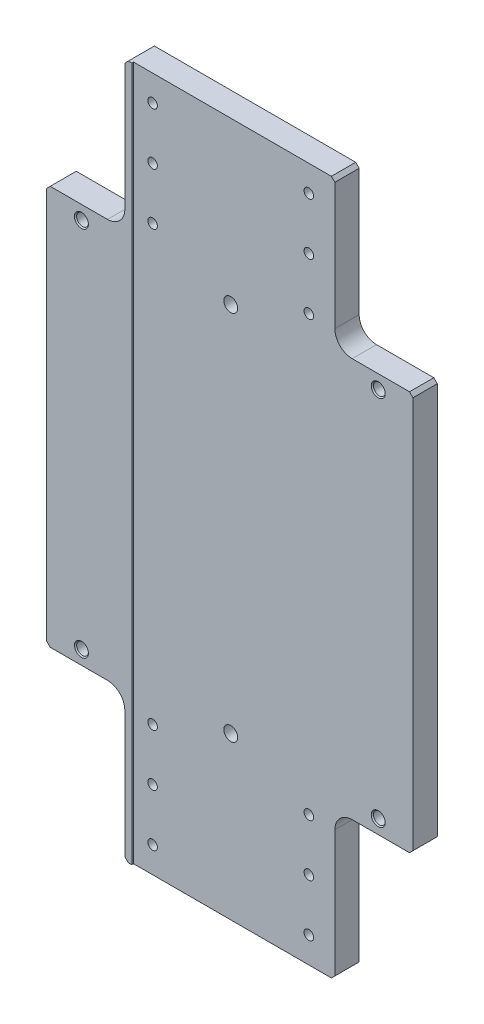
ISO-10303-21;
HEADER;
FILE_DESCRIPTION(('STEP AP214'),'2;1');
FILE_NAME('part.step','',(''),(''),'','','');
FILE_SCHEMA(('AUTOMOTIVE_DESIGN { 1 0 10303 214 1 1 1 1 }'));
ENDSEC;
DATA;
#1=APPLICATION_CONTEXT('core data for automotive mechanical design processes');
#2=APPLICATION_PROTOCOL_DEFINITION('international standard','automotive_design',2000,#1);
#3=PRODUCT_CONTEXT('',#1,'mechanical');
#4=PRODUCT('Part','Part','',(#3));
#5=PRODUCT_RELATED_PRODUCT_CATEGORY('part','',(#4));
#6=PRODUCT_DEFINITION_FORMATION('','',#4);
#7=PRODUCT_DEFINITION_CONTEXT('part definition',#1,'design');
#8=PRODUCT_DEFINITION('design','',#6,#7);
#9=PRODUCT_DEFINITION_SHAPE('','',#8);
#10=(LENGTH_UNIT() NAMED_UNIT(*) SI_UNIT(.MILLI.,.METRE.));
#11=(NAMED_UNIT(*) PLANE_ANGLE_UNIT() SI_UNIT($,.RADIAN.));
#12=(NAMED_UNIT(*) SI_UNIT($,.STERADIAN.) SOLID_ANGLE_UNIT());
#13=UNCERTAINTY_MEASURE_WITH_UNIT(LENGTH_MEASURE(1.E-05),#10,'distance_accuracy_value','');
#14=(GEOMETRIC_REPRESENTATION_CONTEXT(3) GLOBAL_UNCERTAINTY_ASSIGNED_CONTEXT((#13)) GLOBAL_UNIT_ASSIGNED_CONTEXT((#10,
#11,#12)) REPRESENTATION_CONTEXT('',''));
#15=CARTESIAN_POINT('',(0.,0.,0.));
#16=DIRECTION('',(0.,0.,1.));
#17=DIRECTION('',(1.,0.,0.));
#18=AXIS2_PLACEMENT_3D('',#15,#16,#17);
#19=CARTESIAN_POINT('',(60.,-115.,7.5));
#20=DIRECTION('',(-1.,0.,0.));
#21=DIRECTION('',(0.,-1.,0.));
#22=AXIS2_PLACEMENT_3D('',#19,#20,#21);
#23=PLANE('',#22);
#24=DIRECTION('',(0.,1.,0.));
#25=VECTOR('',#24,1.);
#26=CARTESIAN_POINT('',(60.,-115.,6.5));
#27=LINE('',#26,#25);
#28=CARTESIAN_POINT('',(60.,-198.,6.5));
#29=VERTEX_POINT('',#28);
#30=CARTESIAN_POINT('',(60.,-125.,6.5));
#31=VERTEX_POINT('',#30);
#32=EDGE_CURVE('E249',#29,#31,#27,.T.);
#33=ORIENTED_EDGE('',*,*,#32,.F.);
#34=DIRECTION('',(0.,0.,-1.));
#35=VECTOR('',#34,1.);
#36=CARTESIAN_POINT('',(60.,-198.,7.5));
#37=LINE('',#36,#35);
#38=CARTESIAN_POINT('',(60.,-198.,-7.5));
#39=VERTEX_POINT('',#38);
#40=EDGE_CURVE('E421',#29,#39,#37,.T.);
#41=ORIENTED_EDGE('',*,*,#40,.T.);
#42=DIRECTION('',(0.,1.,0.));
#43=VECTOR('',#42,1.);
#44=CARTESIAN_POINT('',(60.,-115.,-7.5));
#45=LINE('',#44,#43);
#46=CARTESIAN_POINT('',(60.,-125.,-7.5));
#47=VERTEX_POINT('',#46);
#48=EDGE_CURVE('E251',#39,#47,#45,.T.);
#49=ORIENTED_EDGE('',*,*,#48,.T.);
#50=DIRECTION('',(0.,0.,-1.));
#51=VECTOR('',#50,1.);
#52=CARTESIAN_POINT('',(60.,-125.,6.5));
#53=LINE('',#52,#51);
#54=EDGE_CURVE('E332',#47,#31,#53,.F.);
#55=ORIENTED_EDGE('',*,*,#54,.T.);
#56=EDGE_LOOP('',(#33,#41,#49,#55));
#57=FACE_BOUND('',#56,.T.);
#58=ADVANCED_FACE('F35',(#57),#23,.F.);
#59=CARTESIAN_POINT('',(105.,-115.,7.5));
#60=DIRECTION('',(0.,1.,0.));
#61=DIRECTION('',(0.,0.,1.));
#62=AXIS2_PLACEMENT_3D('',#59,#60,#61);
#63=PLANE('',#62);
#64=DIRECTION('',(1.,0.,0.));
#65=VECTOR('',#64,1.);
#66=CARTESIAN_POINT('',(105.,-115.,-7.5));
#67=LINE('',#66,#65);
#68=CARTESIAN_POINT('',(70.,-115.,-7.5));
#69=VERTEX_POINT('',#68);
#70=CARTESIAN_POINT('',(103.,-115.,-7.5));
#71=VERTEX_POINT('',#70);
#72=EDGE_CURVE('E273',#69,#71,#67,.T.);
#73=ORIENTED_EDGE('',*,*,#72,.T.);
#74=DIRECTION('',(0.,0.,1.));
#75=VECTOR('',#74,1.);
#76=CARTESIAN_POINT('',(103.,-115.,7.5));
#77=LINE('',#76,#75);
#78=CARTESIAN_POINT('',(103.,-115.,6.5));
#79=VERTEX_POINT('',#78);
#80=EDGE_CURVE('E436',#71,#79,#77,.T.);
#81=ORIENTED_EDGE('',*,*,#80,.T.);
#82=DIRECTION('',(1.,0.,0.));
#83=VECTOR('',#82,1.);
#84=CARTESIAN_POINT('',(105.,-115.,6.5));
#85=LINE('',#84,#83);
#86=CARTESIAN_POINT('',(70.,-115.,6.5));
#87=VERTEX_POINT('',#86);
#88=EDGE_CURVE('E246',#87,#79,#85,.T.);
#89=ORIENTED_EDGE('',*,*,#88,.F.);
#90=DIRECTION('',(0.,0.,-1.));
#91=VECTOR('',#90,1.);
#92=CARTESIAN_POINT('',(70.,-115.,-7.5));
#93=LINE('',#92,#91);
#94=EDGE_CURVE('E271',#87,#69,#93,.T.);
#95=ORIENTED_EDGE('',*,*,#94,.T.);
#96=EDGE_LOOP('',(#73,#81,#89,#95));
#97=FACE_BOUND('',#96,.T.);
#98=ADVANCED_FACE('F522',(#97),#63,.F.);
#99=CARTESIAN_POINT('',(105.,115.,7.5));
#100=DIRECTION('',(-1.,0.,0.));
#101=DIRECTION('',(0.,-1.,0.));
#102=AXIS2_PLACEMENT_3D('',#99,#100,#101);
#103=PLANE('',#102);
#104=DIRECTION('',(0.,1.,0.));
#105=VECTOR('',#104,1.);
#106=CARTESIAN_POINT('',(105.,200.,6.5));
#107=LINE('',#106,#105);
#108=CARTESIAN_POINT('',(105.,-113.,6.5));
#109=VERTEX_POINT('',#108);
#110=CARTESIAN_POINT('',(105.,113.,6.5));
#111=VERTEX_POINT('',#110);
#112=EDGE_CURVE('E233',#109,#111,#107,.T.);
#113=ORIENTED_EDGE('',*,*,#112,.F.);
#114=DIRECTION('',(0.,0.,-1.));
#115=VECTOR('',#114,1.);
#116=CARTESIAN_POINT('',(105.,-113.,7.5));
#117=LINE('',#116,#115);
#118=CARTESIAN_POINT('',(105.,-113.,-7.5));
#119=VERTEX_POINT('',#118);
#120=EDGE_CURVE('E433',#109,#119,#117,.T.);
#121=ORIENTED_EDGE('',*,*,#120,.T.);
#122=DIRECTION('',(0.,1.,0.));
#123=VECTOR('',#122,1.);
#124=CARTESIAN_POINT('',(105.,115.,-7.5));
#125=LINE('',#124,#123);
#126=CARTESIAN_POINT('',(105.,113.,-7.5));
#127=VERTEX_POINT('',#126);
#128=EDGE_CURVE('E276',#119,#127,#125,.T.);
#129=ORIENTED_EDGE('',*,*,#128,.T.);
#130=DIRECTION('',(0.,0.,1.));
#131=VECTOR('',#130,1.);
#132=CARTESIAN_POINT('',(105.,113.,7.5));
#133=LINE('',#132,#131);
#134=EDGE_CURVE('E431',#127,#111,#133,.T.);
#135=ORIENTED_EDGE('',*,*,#134,.T.);
#136=EDGE_LOOP('',(#113,#121,#129,#135));
#137=FACE_BOUND('',#136,.T.);
#138=ADVANCED_FACE('F528',(#137),#103,.F.);
#139=CARTESIAN_POINT('',(60.,115.,7.5));
#140=DIRECTION('',(0.,-1.,0.));
#141=DIRECTION('',(0.,0.,-1.));
#142=AXIS2_PLACEMENT_3D('',#139,#140,#141);
#143=PLANE('',#142);
#144=DIRECTION('',(-1.,0.,0.));
#145=VECTOR('',#144,1.);
#146=CARTESIAN_POINT('',(60.,115.,6.5));
#147=LINE('',#146,#145);
#148=CARTESIAN_POINT('',(103.,115.,6.5));
#149=VERTEX_POINT('',#148);
#150=CARTESIAN_POINT('',(70.,115.,6.5));
#151=VERTEX_POINT('',#150);
#152=EDGE_CURVE('E244',#149,#151,#147,.T.);
#153=ORIENTED_EDGE('',*,*,#152,.F.);
#154=DIRECTION('',(0.,0.,-1.));
#155=VECTOR('',#154,1.);
#156=CARTESIAN_POINT('',(103.,115.,7.5));
#157=LINE('',#156,#155);
#158=CARTESIAN_POINT('',(103.,115.,-7.5));
#159=VERTEX_POINT('',#158);
#160=EDGE_CURVE('E43',#149,#159,#157,.T.);
#161=ORIENTED_EDGE('',*,*,#160,.T.);
#162=DIRECTION('',(-1.,0.,0.));
#163=VECTOR('',#162,1.);
#164=CARTESIAN_POINT('',(60.,115.,-7.5));
#165=LINE('',#164,#163);
#166=CARTESIAN_POINT('',(70.,115.,-7.5));
#167=VERTEX_POINT('',#166);
#168=EDGE_CURVE('E279',#159,#167,#165,.T.);
#169=ORIENTED_EDGE('',*,*,#168,.T.);
#170=DIRECTION('',(0.,0.,-1.));
#171=VECTOR('',#170,1.);
#172=CARTESIAN_POINT('',(70.,115.,6.5));
#173=LINE('',#172,#171);
#174=EDGE_CURVE('E350',#167,#151,#173,.F.);
#175=ORIENTED_EDGE('',*,*,#174,.T.);
#176=EDGE_LOOP('',(#153,#161,#169,#175));
#177=FACE_BOUND('',#176,.T.);
#178=ADVANCED_FACE('F441',(#177),#143,.F.);
#179=CARTESIAN_POINT('',(60.,200.,7.5));
#180=DIRECTION('',(-1.,0.,0.));
#181=DIRECTION('',(0.,-1.,0.));
#182=AXIS2_PLACEMENT_3D('',#179,#180,#181);
#183=PLANE('',#182);
#184=DIRECTION('',(0.,1.,0.));
#185=VECTOR('',#184,1.);
#186=CARTESIAN_POINT('',(60.,200.,-7.5));
#187=LINE('',#186,#185);
#188=CARTESIAN_POINT('',(60.,125.,-7.5));
#189=VERTEX_POINT('',#188);
#190=CARTESIAN_POINT('',(60.,198.,-7.5));
#191=VERTEX_POINT('',#190);
#192=EDGE_CURVE('E281',#189,#191,#187,.T.);
#193=ORIENTED_EDGE('',*,*,#192,.T.);
#194=DIRECTION('',(0.,0.,1.));
#195=VECTOR('',#194,1.);
#196=CARTESIAN_POINT('',(60.,198.,7.5));
#197=LINE('',#196,#195);
#198=CARTESIAN_POINT('',(60.,198.,6.5));
#199=VERTEX_POINT('',#198);
#200=EDGE_CURVE('E11',#191,#199,#197,.T.);
#201=ORIENTED_EDGE('',*,*,#200,.T.);
#202=DIRECTION('',(0.,1.,0.));
#203=VECTOR('',#202,1.);
#204=CARTESIAN_POINT('',(60.,200.,6.5));
#205=LINE('',#204,#203);
#206=CARTESIAN_POINT('',(60.,125.,6.5));
#207=VERTEX_POINT('',#206);
#208=EDGE_CURVE('E241',#207,#199,#205,.T.);
#209=ORIENTED_EDGE('',*,*,#208,.F.);
#210=DIRECTION('',(0.,0.,-1.));
#211=VECTOR('',#210,1.);
#212=CARTESIAN_POINT('',(60.,125.,-7.5));
#213=LINE('',#212,#211);
#214=EDGE_CURVE('E347',#207,#189,#213,.T.);
#215=ORIENTED_EDGE('',*,*,#214,.T.);
#216=EDGE_LOOP('',(#193,#201,#209,#215));
#217=FACE_BOUND('',#216,.T.);
#218=ADVANCED_FACE('F454',(#217),#183,.F.);
#219=CARTESIAN_POINT('',(-60.,200.,7.5));
#220=DIRECTION('',(0.,-1.,0.));
#221=DIRECTION('',(0.,0.,-1.));
#222=AXIS2_PLACEMENT_3D('',#219,#220,#221);
#223=PLANE('',#222);
#224=DIRECTION('',(-1.,0.,0.));
#225=VECTOR('',#224,1.);
#226=CARTESIAN_POINT('',(-60.,200.,-7.5));
#227=LINE('',#226,#225);
#228=CARTESIAN_POINT('',(58.,200.,-7.5));
#229=VERTEX_POINT('',#228);
#230=CARTESIAN_POINT('',(-58.,200.,-7.5));
#231=VERTEX_POINT('',#230);
#232=EDGE_CURVE('E283',#229,#231,#227,.T.);
#233=ORIENTED_EDGE('',*,*,#232,.T.);
#234=DIRECTION('',(0.,0.,1.));
#235=VECTOR('',#234,1.);
#236=CARTESIAN_POINT('',(-58.,200.,7.5));
#237=LINE('',#236,#235);
#238=CARTESIAN_POINT('',(-58.,200.,7.5));
#239=VERTEX_POINT('',#238);
#240=EDGE_CURVE('E410',#231,#239,#237,.T.);
#241=ORIENTED_EDGE('',*,*,#240,.T.);
#242=DIRECTION('',(-1.,0.,0.));
#243=VECTOR('',#242,1.);
#244=CARTESIAN_POINT('',(-60.,200.,7.5));
#245=LINE('',#244,#243);
#246=CARTESIAN_POINT('',(-56.,200.,7.5));
#247=VERTEX_POINT('',#246);
#248=EDGE_CURVE('E252',#247,#239,#245,.T.);
#249=ORIENTED_EDGE('',*,*,#248,.F.);
#250=DIRECTION('',(0.,0.,1.));
#251=VECTOR('',#250,1.);
#252=CARTESIAN_POINT('',(-56.,200.,6.5));
#253=LINE('',#252,#251);
#254=CARTESIAN_POINT('',(-56.,200.,6.5));
#255=VERTEX_POINT('',#254);
#256=EDGE_CURVE('E220',#255,#247,#253,.T.);
#257=ORIENTED_EDGE('',*,*,#256,.F.);
#258=DIRECTION('',(-1.,0.,0.));
#259=VECTOR('',#258,1.);
#260=CARTESIAN_POINT('',(-56.,200.,6.5));
#261=LINE('',#260,#259);
#262=CARTESIAN_POINT('',(58.,200.,6.5));
#263=VERTEX_POINT('',#262);
#264=EDGE_CURVE('E221',#263,#255,#261,.T.);
#265=ORIENTED_EDGE('',*,*,#264,.F.);
#266=DIRECTION('',(0.,0.,-1.));
#267=VECTOR('',#266,1.);
#268=CARTESIAN_POINT('',(58.,200.,7.5));
#269=LINE('',#268,#267);
#270=EDGE_CURVE('E407',#263,#229,#269,.T.);
#271=ORIENTED_EDGE('',*,*,#270,.T.);
#272=EDGE_LOOP('',(#233,#241,#249,#257,#265,#271));
#273=FACE_BOUND('',#272,.T.);
#274=ADVANCED_FACE('F458',(#273),#223,.F.);
#275=CARTESIAN_POINT('',(-60.,200.,7.5));
#276=DIRECTION('',(1.,0.,0.));
#277=DIRECTION('',(0.,1.,0.));
#278=AXIS2_PLACEMENT_3D('',#275,#276,#277);
#279=PLANE('',#278);
#280=DIRECTION('',(0.,-1.,0.));
#281=VECTOR('',#280,1.);
#282=CARTESIAN_POINT('',(-60.,200.,7.5));
#283=LINE('',#282,#281);
#284=CARTESIAN_POINT('',(-60.,198.,7.5));
#285=VERTEX_POINT('',#284);
#286=CARTESIAN_POINT('',(-60.,125.,7.5));
#287=VERTEX_POINT('',#286);
#288=EDGE_CURVE('E255',#285,#287,#283,.T.);
#289=ORIENTED_EDGE('',*,*,#288,.F.);
#290=DIRECTION('',(0.,0.,-1.));
#291=VECTOR('',#290,1.);
#292=CARTESIAN_POINT('',(-60.,198.,7.5));
#293=LINE('',#292,#291);
#294=CARTESIAN_POINT('',(-60.,198.,-7.5));
#295=VERTEX_POINT('',#294);
#296=EDGE_CURVE('E404',#285,#295,#293,.T.);
#297=ORIENTED_EDGE('',*,*,#296,.T.);
#298=DIRECTION('',(0.,-1.,0.));
#299=VECTOR('',#298,1.);
#300=CARTESIAN_POINT('',(-60.,200.,-7.5));
#301=LINE('',#300,#299);
#302=CARTESIAN_POINT('',(-60.,125.,-7.5));
#303=VERTEX_POINT('',#302);
#304=EDGE_CURVE('E286',#295,#303,#301,.T.);
#305=ORIENTED_EDGE('',*,*,#304,.T.);
#306=DIRECTION('',(0.,0.,-1.));
#307=VECTOR('',#306,1.);
#308=CARTESIAN_POINT('',(-60.,125.,7.5));
#309=LINE('',#308,#307);
#310=EDGE_CURVE('E344',#303,#287,#309,.F.);
#311=ORIENTED_EDGE('',*,*,#310,.T.);
#312=EDGE_LOOP('',(#289,#297,#305,#311));
#313=FACE_BOUND('',#312,.T.);
#314=ADVANCED_FACE('F508',(#313),#279,.F.);
#315=CARTESIAN_POINT('',(-60.,115.,7.5));
#316=DIRECTION('',(0.,-1.,0.));
#317=DIRECTION('',(0.,0.,-1.));
#318=AXIS2_PLACEMENT_3D('',#315,#316,#317);
#319=PLANE('',#318);
#320=DIRECTION('',(-1.,0.,0.));
#321=VECTOR('',#320,1.);
#322=CARTESIAN_POINT('',(-60.,115.,-7.5));
#323=LINE('',#322,#321);
#324=CARTESIAN_POINT('',(-70.,115.,-7.5));
#325=VERTEX_POINT('',#324);
#326=CARTESIAN_POINT('',(-103.,115.,-7.5));
#327=VERTEX_POINT('',#326);
#328=EDGE_CURVE('E288',#325,#327,#323,.T.);
#329=ORIENTED_EDGE('',*,*,#328,.T.);
#330=DIRECTION('',(0.,0.,1.));
#331=VECTOR('',#330,1.);
#332=CARTESIAN_POINT('',(-103.,115.,7.5));
#333=LINE('',#332,#331);
#334=CARTESIAN_POINT('',(-103.,115.,7.5));
#335=VERTEX_POINT('',#334);
#336=EDGE_CURVE('E394',#327,#335,#333,.T.);
#337=ORIENTED_EDGE('',*,*,#336,.T.);
#338=DIRECTION('',(-1.,0.,0.));
#339=VECTOR('',#338,1.);
#340=CARTESIAN_POINT('',(-60.,115.,7.5));
#341=LINE('',#340,#339);
#342=CARTESIAN_POINT('',(-70.,115.,7.5));
#343=VERTEX_POINT('',#342);
#344=EDGE_CURVE('E258',#343,#335,#341,.T.);
#345=ORIENTED_EDGE('',*,*,#344,.F.);
#346=DIRECTION('',(0.,0.,-1.));
#347=VECTOR('',#346,1.);
#348=CARTESIAN_POINT('',(-70.,115.,-7.5));
#349=LINE('',#348,#347);
#350=EDGE_CURVE('E341',#343,#325,#349,.T.);
#351=ORIENTED_EDGE('',*,*,#350,.T.);
#352=EDGE_LOOP('',(#329,#337,#345,#351));
#353=FACE_BOUND('',#352,.T.);
#354=ADVANCED_FACE('F499',(#353),#319,.F.);
#355=CARTESIAN_POINT('',(-105.,115.,7.5));
#356=DIRECTION('',(1.,0.,0.));
#357=DIRECTION('',(0.,1.,0.));
#358=AXIS2_PLACEMENT_3D('',#355,#356,#357);
#359=PLANE('',#358);
#360=DIRECTION('',(0.,-1.,0.));
#361=VECTOR('',#360,1.);
#362=CARTESIAN_POINT('',(-105.,115.,7.5));
#363=LINE('',#362,#361);
#364=CARTESIAN_POINT('',(-105.,113.,7.5));
#365=VERTEX_POINT('',#364);
#366=CARTESIAN_POINT('',(-105.,-113.,7.5));
#367=VERTEX_POINT('',#366);
#368=EDGE_CURVE('E261',#365,#367,#363,.T.);
#369=ORIENTED_EDGE('',*,*,#368,.F.);
#370=DIRECTION('',(0.,0.,-1.));
#371=VECTOR('',#370,1.);
#372=CARTESIAN_POINT('',(-105.,113.,7.5));
#373=LINE('',#372,#371);
#374=CARTESIAN_POINT('',(-105.,113.,-7.5));
#375=VERTEX_POINT('',#374);
#376=EDGE_CURVE('E375',#365,#375,#373,.T.);
#377=ORIENTED_EDGE('',*,*,#376,.T.);
#378=DIRECTION('',(0.,-1.,0.));
#379=VECTOR('',#378,1.);
#380=CARTESIAN_POINT('',(-105.,115.,-7.5));
#381=LINE('',#380,#379);
#382=CARTESIAN_POINT('',(-105.,-113.,-7.5));
#383=VERTEX_POINT('',#382);
#384=EDGE_CURVE('E291',#375,#383,#381,.T.);
#385=ORIENTED_EDGE('',*,*,#384,.T.);
#386=DIRECTION('',(0.,0.,1.));
#387=VECTOR('',#386,1.);
#388=CARTESIAN_POINT('',(-105.,-113.,7.5));
#389=LINE('',#388,#387);
#390=EDGE_CURVE('E373',#383,#367,#389,.T.);
#391=ORIENTED_EDGE('',*,*,#390,.T.);
#392=EDGE_LOOP('',(#369,#377,#385,#391));
#393=FACE_BOUND('',#392,.T.);
#394=ADVANCED_FACE('F490',(#393),#359,.F.);
#395=CARTESIAN_POINT('',(-105.,-115.,7.5));
#396=DIRECTION('',(0.,1.,0.));
#397=DIRECTION('',(0.,0.,1.));
#398=AXIS2_PLACEMENT_3D('',#395,#396,#397);
#399=PLANE('',#398);
#400=DIRECTION('',(1.,0.,0.));
#401=VECTOR('',#400,1.);
#402=CARTESIAN_POINT('',(-105.,-115.,7.5));
#403=LINE('',#402,#401);
#404=CARTESIAN_POINT('',(-103.,-115.,7.5));
#405=VERTEX_POINT('',#404);
#406=CARTESIAN_POINT('',(-70.,-115.,7.5));
#407=VERTEX_POINT('',#406);
#408=EDGE_CURVE('E264',#405,#407,#403,.T.);
#409=ORIENTED_EDGE('',*,*,#408,.F.);
#410=DIRECTION('',(0.,0.,-1.));
#411=VECTOR('',#410,1.);
#412=CARTESIAN_POINT('',(-103.,-115.,7.5));
#413=LINE('',#412,#411);
#414=CARTESIAN_POINT('',(-103.,-115.,-7.5));
#415=VERTEX_POINT('',#414);
#416=EDGE_CURVE('E412',#405,#415,#413,.T.);
#417=ORIENTED_EDGE('',*,*,#416,.T.);
#418=DIRECTION('',(1.,0.,0.));
#419=VECTOR('',#418,1.);
#420=CARTESIAN_POINT('',(-105.,-115.,-7.5));
#421=LINE('',#420,#419);
#422=CARTESIAN_POINT('',(-70.,-115.,-7.5));
#423=VERTEX_POINT('',#422);
#424=EDGE_CURVE('E294',#415,#423,#421,.T.);
#425=ORIENTED_EDGE('',*,*,#424,.T.);
#426=DIRECTION('',(0.,0.,-1.));
#427=VECTOR('',#426,1.);
#428=CARTESIAN_POINT('',(-70.,-115.,7.5));
#429=LINE('',#428,#427);
#430=EDGE_CURVE('E338',#423,#407,#429,.F.);
#431=ORIENTED_EDGE('',*,*,#430,.T.);
#432=EDGE_LOOP('',(#409,#417,#425,#431));
#433=FACE_BOUND('',#432,.T.);
#434=ADVANCED_FACE('F482',(#433),#399,.F.);
#435=CARTESIAN_POINT('',(-60.,-115.,7.5));
#436=DIRECTION('',(1.,0.,0.));
#437=DIRECTION('',(0.,1.,0.));
#438=AXIS2_PLACEMENT_3D('',#435,#436,#437);
#439=PLANE('',#438);
#440=DIRECTION('',(0.,-1.,0.));
#441=VECTOR('',#440,1.);
#442=CARTESIAN_POINT('',(-60.,-115.,-7.5));
#443=LINE('',#442,#441);
#444=CARTESIAN_POINT('',(-60.,-125.,-7.5));
#445=VERTEX_POINT('',#444);
#446=CARTESIAN_POINT('',(-60.,-198.,-7.5));
#447=VERTEX_POINT('',#446);
#448=EDGE_CURVE('E296',#445,#447,#443,.T.);
#449=ORIENTED_EDGE('',*,*,#448,.T.);
#450=DIRECTION('',(0.,0.,1.));
#451=VECTOR('',#450,1.);
#452=CARTESIAN_POINT('',(-60.,-198.,7.5));
#453=LINE('',#452,#451);
#454=CARTESIAN_POINT('',(-60.,-198.,7.5));
#455=VERTEX_POINT('',#454);
#456=EDGE_CURVE('E419',#447,#455,#453,.T.);
#457=ORIENTED_EDGE('',*,*,#456,.T.);
#458=DIRECTION('',(0.,-1.,0.));
#459=VECTOR('',#458,1.);
#460=CARTESIAN_POINT('',(-60.,-115.,7.5));
#461=LINE('',#460,#459);
#462=CARTESIAN_POINT('',(-60.,-125.,7.5));
#463=VERTEX_POINT('',#462);
#464=EDGE_CURVE('E266',#463,#455,#461,.T.);
#465=ORIENTED_EDGE('',*,*,#464,.F.);
#466=DIRECTION('',(0.,0.,-1.));
#467=VECTOR('',#466,1.);
#468=CARTESIAN_POINT('',(-60.,-125.,-7.5));
#469=LINE('',#468,#467);
#470=EDGE_CURVE('E335',#463,#445,#469,.T.);
#471=ORIENTED_EDGE('',*,*,#470,.T.);
#472=EDGE_LOOP('',(#449,#457,#465,#471));
#473=FACE_BOUND('',#472,.T.);
#474=ADVANCED_FACE('F472',(#473),#439,.F.);
#475=CARTESIAN_POINT('',(-60.,-200.,7.5));
#476=DIRECTION('',(0.,1.,0.));
#477=DIRECTION('',(0.,0.,1.));
#478=AXIS2_PLACEMENT_3D('',#475,#476,#477);
#479=PLANE('',#478);
#480=DIRECTION('',(1.,0.,0.));
#481=VECTOR('',#480,1.);
#482=CARTESIAN_POINT('',(-60.,-200.,7.5));
#483=LINE('',#482,#481);
#484=CARTESIAN_POINT('',(-58.,-200.,7.5));
#485=VERTEX_POINT('',#484);
#486=CARTESIAN_POINT('',(-56.,-200.,7.5));
#487=VERTEX_POINT('',#486);
#488=EDGE_CURVE('E269',#485,#487,#483,.T.);
#489=ORIENTED_EDGE('',*,*,#488,.F.);
#490=DIRECTION('',(0.,0.,-1.));
#491=VECTOR('',#490,1.);
#492=CARTESIAN_POINT('',(-58.,-200.,7.5));
#493=LINE('',#492,#491);
#494=CARTESIAN_POINT('',(-58.,-200.,-7.5));
#495=VERTEX_POINT('',#494);
#496=EDGE_CURVE('E416',#485,#495,#493,.T.);
#497=ORIENTED_EDGE('',*,*,#496,.T.);
#498=DIRECTION('',(1.,0.,0.));
#499=VECTOR('',#498,1.);
#500=CARTESIAN_POINT('',(-60.,-200.,-7.5));
#501=LINE('',#500,#499);
#502=CARTESIAN_POINT('',(58.0000000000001,-200.,-7.5));
#503=VERTEX_POINT('',#502);
#504=EDGE_CURVE('E256',#495,#503,#501,.T.);
#505=ORIENTED_EDGE('',*,*,#504,.T.);
#506=DIRECTION('',(0.,0.,1.));
#507=VECTOR('',#506,1.);
#508=CARTESIAN_POINT('',(58.0000000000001,-200.,7.5));
#509=LINE('',#508,#507);
#510=CARTESIAN_POINT('',(58.0000000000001,-200.,6.5));
#511=VERTEX_POINT('',#510);
#512=EDGE_CURVE('E232',#503,#511,#509,.T.);
#513=ORIENTED_EDGE('',*,*,#512,.T.);
#514=DIRECTION('',(1.,0.,0.));
#515=VECTOR('',#514,1.);
#516=CARTESIAN_POINT('',(-56.,-200.,6.5));
#517=LINE('',#516,#515);
#518=CARTESIAN_POINT('',(-56.,-200.,6.5));
#519=VERTEX_POINT('',#518);
#520=EDGE_CURVE('E225',#519,#511,#517,.T.);
#521=ORIENTED_EDGE('',*,*,#520,.F.);
#522=DIRECTION('',(0.,0.,1.));
#523=VECTOR('',#522,1.);
#524=CARTESIAN_POINT('',(-56.,-200.,6.5));
#525=LINE('',#524,#523);
#526=EDGE_CURVE('E210',#519,#487,#525,.T.);
#527=ORIENTED_EDGE('',*,*,#526,.T.);
#528=EDGE_LOOP('',(#489,#497,#505,#513,#521,#527));
#529=FACE_BOUND('',#528,.T.);
#530=ADVANCED_FACE('F229',(#529),#479,.F.);
#531=CARTESIAN_POINT('',(0.,0.,7.5));
#532=DIRECTION('',(0.,0.,1.));
#533=DIRECTION('',(1.,0.,0.));
#534=AXIS2_PLACEMENT_3D('',#531,#532,#533);
#535=PLANE('',#534);
#536=CARTESIAN_POINT('',(-85.,107.,7.5));
#537=DIRECTION('',(0.,0.,1.));
#538=DIRECTION('',(1.,0.,0.));
#539=AXIS2_PLACEMENT_3D('',#536,#537,#538);
#540=CIRCLE('',#539,4.025);
#541=CARTESIAN_POINT('',(-80.975,107.,7.5));
#542=VERTEX_POINT('',#541);
#543=EDGE_CURVE('E1016',#542,#542,#540,.T.);
#544=ORIENTED_EDGE('',*,*,#543,.F.);
#545=EDGE_LOOP('',(#544));
#546=FACE_BOUND('',#545,.T.);
#547=CARTESIAN_POINT('',(-85.,-107.,7.5));
#548=DIRECTION('',(0.,0.,1.));
#549=DIRECTION('',(1.,0.,0.));
#550=AXIS2_PLACEMENT_3D('',#547,#548,#549);
#551=CIRCLE('',#550,4.025);
#552=CARTESIAN_POINT('',(-80.975,-107.,7.5));
#553=VERTEX_POINT('',#552);
#554=EDGE_CURVE('E1028',#553,#553,#551,.T.);
#555=ORIENTED_EDGE('',*,*,#554,.F.);
#556=EDGE_LOOP('',(#555));
#557=FACE_BOUND('',#556,.T.);
#558=ORIENTED_EDGE('',*,*,#344,.T.);
#559=DIRECTION('',(0.70710678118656,0.707106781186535,0.));
#560=VECTOR('',#559,1.);
#561=CARTESIAN_POINT('',(-108.999999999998,109.000000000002,7.5));
#562=LINE('',#561,#560);
#563=EDGE_CURVE('E402',#335,#365,#562,.F.);
#564=ORIENTED_EDGE('',*,*,#563,.T.);
#565=ORIENTED_EDGE('',*,*,#368,.T.);
#566=DIRECTION('',(-0.707106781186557,0.707106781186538,0.));
#567=VECTOR('',#566,1.);
#568=CARTESIAN_POINT('',(-108.999999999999,-109.000000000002,7.5));
#569=LINE('',#568,#567);
#570=EDGE_CURVE('E398',#367,#405,#569,.F.);
#571=ORIENTED_EDGE('',*,*,#570,.T.);
#572=ORIENTED_EDGE('',*,*,#408,.T.);
#573=CARTESIAN_POINT('',(-70.,-125.,7.5));
#574=DIRECTION('',(0.,0.,1.));
#575=DIRECTION('',(1.,0.,0.));
#576=AXIS2_PLACEMENT_3D('',#573,#574,#575);
#577=CIRCLE('',#576,10.);
#578=EDGE_CURVE('E361',#407,#463,#577,.F.);
#579=ORIENTED_EDGE('',*,*,#578,.T.);
#580=ORIENTED_EDGE('',*,*,#464,.T.);
#581=DIRECTION('',(-0.707106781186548,0.707106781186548,0.));
#582=VECTOR('',#581,1.);
#583=CARTESIAN_POINT('',(-129.,-129.,7.5));
#584=LINE('',#583,#582);
#585=EDGE_CURVE('E396',#455,#485,#584,.F.);
#586=ORIENTED_EDGE('',*,*,#585,.T.);
#587=ORIENTED_EDGE('',*,*,#488,.T.);
#588=DIRECTION('',(0.,-1.,0.));
#589=VECTOR('',#588,1.);
#590=CARTESIAN_POINT('',(-56.,200.,7.5));
#591=LINE('',#590,#589);
#592=EDGE_CURVE('E216',#247,#487,#591,.T.);
#593=ORIENTED_EDGE('',*,*,#592,.F.);
#594=ORIENTED_EDGE('',*,*,#248,.T.);
#595=DIRECTION('',(0.707106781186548,0.707106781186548,0.));
#596=VECTOR('',#595,1.);
#597=CARTESIAN_POINT('',(-129.,129.,7.5));
#598=LINE('',#597,#596);
#599=EDGE_CURVE('E400',#239,#285,#598,.F.);
#600=ORIENTED_EDGE('',*,*,#599,.T.);
#601=ORIENTED_EDGE('',*,*,#288,.T.);
#602=CARTESIAN_POINT('',(-70.,125.,7.5));
#603=DIRECTION('',(0.,0.,1.));
#604=DIRECTION('',(1.,0.,0.));
#605=AXIS2_PLACEMENT_3D('',#602,#603,#604);
#606=CIRCLE('',#605,10.);
#607=EDGE_CURVE('E366',#287,#343,#606,.F.);
#608=ORIENTED_EDGE('',*,*,#607,.T.);
#609=EDGE_LOOP('',(#558,#564,#565,#571,#572,#579,#580,#586,#587,#593,#594,#600,#601,#608));
#610=FACE_BOUND('',#609,.T.);
#611=ADVANCED_FACE('F462',(#546,#557,#610),#535,.T.);
#612=CARTESIAN_POINT('',(0.,0.,-7.5));
#613=DIRECTION('',(0.,0.,1.));
#614=DIRECTION('',(1.,0.,0.));
#615=AXIS2_PLACEMENT_3D('',#612,#613,#614);
#616=PLANE('',#615);
#617=CARTESIAN_POINT('',(-45.,-125.,-7.5));
#618=DIRECTION('',(0.,0.,-1.));
#619=DIRECTION('',(-1.,0.,0.));
#620=AXIS2_PLACEMENT_3D('',#617,#618,#619);
#621=CIRCLE('',#620,4.75);
#622=CARTESIAN_POINT('',(-49.75,-125.,-7.5));
#623=VERTEX_POINT('',#622);
#624=EDGE_CURVE('E865',#623,#623,#621,.T.);
#625=ORIENTED_EDGE('',*,*,#624,.F.);
#626=EDGE_LOOP('',(#625));
#627=FACE_BOUND('',#626,.T.);
#628=CARTESIAN_POINT('',(45.,-155.,-7.5));
#629=DIRECTION('',(0.,0.,-1.));
#630=DIRECTION('',(-1.,0.,0.));
#631=AXIS2_PLACEMENT_3D('',#628,#629,#630);
#632=CIRCLE('',#631,4.75);
#633=CARTESIAN_POINT('',(40.25,-155.,-7.5));
#634=VERTEX_POINT('',#633);
#635=EDGE_CURVE('E875',#634,#634,#632,.T.);
#636=ORIENTED_EDGE('',*,*,#635,.F.);
#637=EDGE_LOOP('',(#636));
#638=FACE_BOUND('',#637,.T.);
#639=CARTESIAN_POINT('',(-45.,-155.,-7.5));
#640=DIRECTION('',(0.,0.,-1.));
#641=DIRECTION('',(-1.,0.,0.));
#642=AXIS2_PLACEMENT_3D('',#639,#640,#641);
#643=CIRCLE('',#642,4.75);
#644=CARTESIAN_POINT('',(-49.75,-155.,-7.5));
#645=VERTEX_POINT('',#644);
#646=EDGE_CURVE('E887',#645,#645,#643,.T.);
#647=ORIENTED_EDGE('',*,*,#646,.F.);
#648=EDGE_LOOP('',(#647));
#649=FACE_BOUND('',#648,.T.);
#650=CARTESIAN_POINT('',(45.,-185.,-7.5));
#651=DIRECTION('',(0.,0.,-1.));
#652=DIRECTION('',(-1.,0.,0.));
#653=AXIS2_PLACEMENT_3D('',#650,#651,#652);
#654=CIRCLE('',#653,4.75);
#655=CARTESIAN_POINT('',(40.25,-185.,-7.5));
#656=VERTEX_POINT('',#655);
#657=EDGE_CURVE('E899',#656,#656,#654,.T.);
#658=ORIENTED_EDGE('',*,*,#657,.F.);
#659=EDGE_LOOP('',(#658));
#660=FACE_BOUND('',#659,.T.);
#661=CARTESIAN_POINT('',(-45.,-185.,-7.5));
#662=DIRECTION('',(0.,0.,-1.));
#663=DIRECTION('',(-1.,0.,0.));
#664=AXIS2_PLACEMENT_3D('',#661,#662,#663);
#665=CIRCLE('',#664,4.75);
#666=CARTESIAN_POINT('',(-49.75,-185.,-7.5));
#667=VERTEX_POINT('',#666);
#668=EDGE_CURVE('E911',#667,#667,#665,.T.);
#669=ORIENTED_EDGE('',*,*,#668,.F.);
#670=EDGE_LOOP('',(#669));
#671=FACE_BOUND('',#670,.T.);
#672=CARTESIAN_POINT('',(45.,-125.,-7.5));
#673=DIRECTION('',(0.,0.,-1.));
#674=DIRECTION('',(-1.,0.,0.));
#675=AXIS2_PLACEMENT_3D('',#672,#673,#674);
#676=CIRCLE('',#675,4.75);
#677=CARTESIAN_POINT('',(40.25,-125.,-7.5));
#678=VERTEX_POINT('',#677);
#679=EDGE_CURVE('E923',#678,#678,#676,.T.);
#680=ORIENTED_EDGE('',*,*,#679,.F.);
#681=EDGE_LOOP('',(#680));
#682=FACE_BOUND('',#681,.T.);
#683=CARTESIAN_POINT('',(45.,185.,-7.5));
#684=DIRECTION('',(0.,0.,-1.));
#685=DIRECTION('',(-1.,0.,0.));
#686=AXIS2_PLACEMENT_3D('',#683,#684,#685);
#687=CIRCLE('',#686,4.75);
#688=CARTESIAN_POINT('',(40.25,185.,-7.5));
#689=VERTEX_POINT('',#688);
#690=EDGE_CURVE('E935',#689,#689,#687,.T.);
#691=ORIENTED_EDGE('',*,*,#690,.F.);
#692=EDGE_LOOP('',(#691));
#693=FACE_BOUND('',#692,.T.);
#694=CARTESIAN_POINT('',(-45.,185.,-7.5));
#695=DIRECTION('',(0.,0.,-1.));
#696=DIRECTION('',(-1.,0.,0.));
#697=AXIS2_PLACEMENT_3D('',#694,#695,#696);
#698=CIRCLE('',#697,4.75);
#699=CARTESIAN_POINT('',(-49.75,185.,-7.5));
#700=VERTEX_POINT('',#699);
#701=EDGE_CURVE('E328',#700,#700,#698,.T.);
#702=ORIENTED_EDGE('',*,*,#701,.F.);
#703=EDGE_LOOP('',(#702));
#704=FACE_BOUND('',#703,.T.);
#705=CARTESIAN_POINT('',(45.,155.,-7.5));
#706=DIRECTION('',(0.,0.,-1.));
#707=DIRECTION('',(-1.,0.,0.));
#708=AXIS2_PLACEMENT_3D('',#705,#706,#707);
#709=CIRCLE('',#708,4.75);
#710=CARTESIAN_POINT('',(40.25,155.,-7.5));
#711=VERTEX_POINT('',#710);
#712=EDGE_CURVE('E323',#711,#711,#709,.T.);
#713=ORIENTED_EDGE('',*,*,#712,.F.);
#714=EDGE_LOOP('',(#713));
#715=FACE_BOUND('',#714,.T.);
#716=CARTESIAN_POINT('',(-45.,155.,-7.5));
#717=DIRECTION('',(0.,0.,-1.));
#718=DIRECTION('',(-1.,0.,0.));
#719=AXIS2_PLACEMENT_3D('',#716,#717,#718);
#720=CIRCLE('',#719,4.75);
#721=CARTESIAN_POINT('',(-49.75,155.,-7.5));
#722=VERTEX_POINT('',#721);
#723=EDGE_CURVE('E318',#722,#722,#720,.T.);
#724=ORIENTED_EDGE('',*,*,#723,.F.);
#725=EDGE_LOOP('',(#724));
#726=FACE_BOUND('',#725,.T.);
#727=CARTESIAN_POINT('',(45.,125.,-7.5));
#728=DIRECTION('',(0.,0.,-1.));
#729=DIRECTION('',(-1.,0.,0.));
#730=AXIS2_PLACEMENT_3D('',#727,#728,#729);
#731=CIRCLE('',#730,4.75);
#732=CARTESIAN_POINT('',(40.25,125.,-7.5));
#733=VERTEX_POINT('',#732);
#734=EDGE_CURVE('E313',#733,#733,#731,.T.);
#735=ORIENTED_EDGE('',*,*,#734,.F.);
#736=EDGE_LOOP('',(#735));
#737=FACE_BOUND('',#736,.T.);
#738=CARTESIAN_POINT('',(-45.,125.,-7.5));
#739=DIRECTION('',(0.,0.,-1.));
#740=DIRECTION('',(-1.,0.,0.));
#741=AXIS2_PLACEMENT_3D('',#738,#739,#740);
#742=CIRCLE('',#741,4.75);
#743=CARTESIAN_POINT('',(-49.75,125.,-7.5));
#744=VERTEX_POINT('',#743);
#745=EDGE_CURVE('E308',#744,#744,#742,.T.);
#746=ORIENTED_EDGE('',*,*,#745,.F.);
#747=EDGE_LOOP('',(#746));
#748=FACE_BOUND('',#747,.T.);
#749=CARTESIAN_POINT('',(0.,107.,-7.5));
#750=DIRECTION('',(0.,0.,1.));
#751=DIRECTION('',(1.,0.,0.));
#752=AXIS2_PLACEMENT_3D('',#749,#750,#751);
#753=CIRCLE('',#752,4.);
#754=CARTESIAN_POINT('',(4.,107.,-7.5));
#755=VERTEX_POINT('',#754);
#756=EDGE_CURVE('E980',#755,#755,#753,.T.);
#757=ORIENTED_EDGE('',*,*,#756,.T.);
#758=EDGE_LOOP('',(#757));
#759=FACE_BOUND('',#758,.T.);
#760=CARTESIAN_POINT('',(0.,-107.,-7.5));
#761=DIRECTION('',(0.,0.,1.));
#762=DIRECTION('',(1.,0.,0.));
#763=AXIS2_PLACEMENT_3D('',#760,#761,#762);
#764=CIRCLE('',#763,4.);
#765=CARTESIAN_POINT('',(4.,-107.,-7.5));
#766=VERTEX_POINT('',#765);
#767=EDGE_CURVE('E986',#766,#766,#764,.T.);
#768=ORIENTED_EDGE('',*,*,#767,.T.);
#769=EDGE_LOOP('',(#768));
#770=FACE_BOUND('',#769,.T.);
#771=CARTESIAN_POINT('',(85.,107.,-7.5));
#772=DIRECTION('',(0.,0.,1.));
#773=DIRECTION('',(1.,0.,0.));
#774=AXIS2_PLACEMENT_3D('',#771,#772,#773);
#775=CIRCLE('',#774,4.025);
#776=CARTESIAN_POINT('',(89.025,107.,-7.5));
#777=VERTEX_POINT('',#776);
#778=EDGE_CURVE('E989',#777,#777,#775,.T.);
#779=ORIENTED_EDGE('',*,*,#778,.T.);
#780=EDGE_LOOP('',(#779));
#781=FACE_BOUND('',#780,.T.);
#782=CARTESIAN_POINT('',(85.,-107.,-7.5));
#783=DIRECTION('',(0.,0.,1.));
#784=DIRECTION('',(1.,0.,0.));
#785=AXIS2_PLACEMENT_3D('',#782,#783,#784);
#786=CIRCLE('',#785,4.025);
#787=CARTESIAN_POINT('',(89.025,-107.,-7.5));
#788=VERTEX_POINT('',#787);
#789=EDGE_CURVE('E1001',#788,#788,#786,.T.);
#790=ORIENTED_EDGE('',*,*,#789,.T.);
#791=EDGE_LOOP('',(#790));
#792=FACE_BOUND('',#791,.T.);
#793=CARTESIAN_POINT('',(-85.,107.,-7.5));
#794=DIRECTION('',(0.,0.,1.));
#795=DIRECTION('',(1.,0.,0.));
#796=AXIS2_PLACEMENT_3D('',#793,#794,#795);
#797=CIRCLE('',#796,4.025);
#798=CARTESIAN_POINT('',(-80.975,107.,-7.5));
#799=VERTEX_POINT('',#798);
#800=EDGE_CURVE('E1013',#799,#799,#797,.T.);
#801=ORIENTED_EDGE('',*,*,#800,.T.);
#802=EDGE_LOOP('',(#801));
#803=FACE_BOUND('',#802,.T.);
#804=CARTESIAN_POINT('',(-85.,-107.,-7.5));
#805=DIRECTION('',(0.,0.,1.));
#806=DIRECTION('',(1.,0.,0.));
#807=AXIS2_PLACEMENT_3D('',#804,#805,#806);
#808=CIRCLE('',#807,4.025);
#809=CARTESIAN_POINT('',(-80.975,-107.,-7.5));
#810=VERTEX_POINT('',#809);
#811=EDGE_CURVE('E1025',#810,#810,#808,.T.);
#812=ORIENTED_EDGE('',*,*,#811,.T.);
#813=EDGE_LOOP('',(#812));
#814=FACE_BOUND('',#813,.T.);
#815=ORIENTED_EDGE('',*,*,#384,.F.);
#816=DIRECTION('',(-0.70710678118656,-0.707106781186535,0.));
#817=VECTOR('',#816,1.);
#818=CARTESIAN_POINT('',(-105.,113.,-7.5));
#819=LINE('',#818,#817);
#820=EDGE_CURVE('E392',#375,#327,#819,.F.);
#821=ORIENTED_EDGE('',*,*,#820,.T.);
#822=ORIENTED_EDGE('',*,*,#328,.F.);
#823=CARTESIAN_POINT('',(-70.,125.,-7.5));
#824=DIRECTION('',(0.,0.,1.));
#825=DIRECTION('',(1.,0.,0.));
#826=AXIS2_PLACEMENT_3D('',#823,#824,#825);
#827=CIRCLE('',#826,10.);
#828=EDGE_CURVE('E363',#325,#303,#827,.T.);
#829=ORIENTED_EDGE('',*,*,#828,.T.);
#830=ORIENTED_EDGE('',*,*,#304,.F.);
#831=DIRECTION('',(-0.707106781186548,-0.707106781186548,0.));
#832=VECTOR('',#831,1.);
#833=CARTESIAN_POINT('',(-60.,198.,-7.5));
#834=LINE('',#833,#832);
#835=EDGE_CURVE('E390',#295,#231,#834,.F.);
#836=ORIENTED_EDGE('',*,*,#835,.T.);
#837=ORIENTED_EDGE('',*,*,#232,.F.);
#838=DIRECTION('',(-0.707106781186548,0.707106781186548,0.));
#839=VECTOR('',#838,1.);
#840=CARTESIAN_POINT('',(58.,200.,-7.5));
#841=LINE('',#840,#839);
#842=EDGE_CURVE('E378',#229,#191,#841,.F.);
#843=ORIENTED_EDGE('',*,*,#842,.T.);
#844=ORIENTED_EDGE('',*,*,#192,.F.);
#845=CARTESIAN_POINT('',(70.,125.,-7.5));
#846=DIRECTION('',(0.,0.,1.));
#847=DIRECTION('',(1.,0.,0.));
#848=AXIS2_PLACEMENT_3D('',#845,#846,#847);
#849=CIRCLE('',#848,10.);
#850=EDGE_CURVE('E368',#189,#167,#849,.T.);
#851=ORIENTED_EDGE('',*,*,#850,.T.);
#852=ORIENTED_EDGE('',*,*,#168,.F.);
#853=DIRECTION('',(-0.707106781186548,0.707106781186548,0.));
#854=VECTOR('',#853,1.);
#855=CARTESIAN_POINT('',(103.,115.,-7.5));
#856=LINE('',#855,#854);
#857=EDGE_CURVE('E380',#159,#127,#856,.F.);
#858=ORIENTED_EDGE('',*,*,#857,.T.);
#859=ORIENTED_EDGE('',*,*,#128,.F.);
#860=DIRECTION('',(0.707106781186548,0.707106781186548,0.));
#861=VECTOR('',#860,1.);
#862=CARTESIAN_POINT('',(105.,-113.,-7.5));
#863=LINE('',#862,#861);
#864=EDGE_CURVE('E382',#119,#71,#863,.F.);
#865=ORIENTED_EDGE('',*,*,#864,.T.);
#866=ORIENTED_EDGE('',*,*,#72,.F.);
#867=CARTESIAN_POINT('',(70.,-125.,-7.5));
#868=DIRECTION('',(0.,0.,1.));
#869=DIRECTION('',(1.,0.,0.));
#870=AXIS2_PLACEMENT_3D('',#867,#868,#869);
#871=CIRCLE('',#870,10.);
#872=EDGE_CURVE('E353',#69,#47,#871,.T.);
#873=ORIENTED_EDGE('',*,*,#872,.T.);
#874=ORIENTED_EDGE('',*,*,#48,.F.);
#875=DIRECTION('',(0.707106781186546,0.707106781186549,0.));
#876=VECTOR('',#875,1.);
#877=CARTESIAN_POINT('',(60.,-198.,-7.5));
#878=LINE('',#877,#876);
#879=EDGE_CURVE('E384',#39,#503,#878,.F.);
#880=ORIENTED_EDGE('',*,*,#879,.T.);
#881=ORIENTED_EDGE('',*,*,#504,.F.);
#882=DIRECTION('',(0.707106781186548,-0.707106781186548,0.));
#883=VECTOR('',#882,1.);
#884=CARTESIAN_POINT('',(-58.,-200.,-7.5));
#885=LINE('',#884,#883);
#886=EDGE_CURVE('E386',#495,#447,#885,.F.);
#887=ORIENTED_EDGE('',*,*,#886,.T.);
#888=ORIENTED_EDGE('',*,*,#448,.F.);
#889=CARTESIAN_POINT('',(-70.,-125.,-7.5));
#890=DIRECTION('',(0.,0.,1.));
#891=DIRECTION('',(1.,0.,0.));
#892=AXIS2_PLACEMENT_3D('',#889,#890,#891);
#893=CIRCLE('',#892,10.);
#894=EDGE_CURVE('E358',#445,#423,#893,.T.);
#895=ORIENTED_EDGE('',*,*,#894,.T.);
#896=ORIENTED_EDGE('',*,*,#424,.F.);
#897=DIRECTION('',(0.707106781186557,-0.707106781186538,0.));
#898=VECTOR('',#897,1.);
#899=CARTESIAN_POINT('',(-103.,-115.,-7.5));
#900=LINE('',#899,#898);
#901=EDGE_CURVE('E388',#415,#383,#900,.F.);
#902=ORIENTED_EDGE('',*,*,#901,.T.);
#903=EDGE_LOOP('',(#815,#821,#822,#829,#830,#836,#837,#843,#844,#851,#852,#858,#859,#865,#866,
#873,#874,#880,#881,#887,#888,#895,#896,#902));
#904=FACE_BOUND('',#903,.T.);
#905=ADVANCED_FACE('F445',(#627,#638,#649,#660,#671,#682,#693,#704,#715,#726,#737,#748,#759,
#770,#781,#792,#803,#814,#904),#616,.F.);
#906=CARTESIAN_POINT('',(0.,0.,6.5));
#907=DIRECTION('',(0.,0.,1.));
#908=DIRECTION('',(1.,0.,0.));
#909=AXIS2_PLACEMENT_3D('',#906,#907,#908);
#910=PLANE('',#909);
#911=CARTESIAN_POINT('',(-45.,-125.,6.5));
#912=DIRECTION('',(0.,0.,1.));
#913=DIRECTION('',(1.,0.,0.));
#914=AXIS2_PLACEMENT_3D('',#911,#912,#913);
#915=CIRCLE('',#914,2.75);
#916=CARTESIAN_POINT('',(-42.25,-125.,6.5));
#917=VERTEX_POINT('',#916);
#918=EDGE_CURVE('E866',#917,#917,#915,.T.);
#919=ORIENTED_EDGE('',*,*,#918,.F.);
#920=EDGE_LOOP('',(#919));
#921=FACE_BOUND('',#920,.T.);
#922=CARTESIAN_POINT('',(45.,-155.,6.5));
#923=DIRECTION('',(0.,0.,1.));
#924=DIRECTION('',(1.,0.,0.));
#925=AXIS2_PLACEMENT_3D('',#922,#923,#924);
#926=CIRCLE('',#925,2.75);
#927=CARTESIAN_POINT('',(47.75,-155.,6.5));
#928=VERTEX_POINT('',#927);
#929=EDGE_CURVE('E878',#928,#928,#926,.T.);
#930=ORIENTED_EDGE('',*,*,#929,.F.);
#931=EDGE_LOOP('',(#930));
#932=FACE_BOUND('',#931,.T.);
#933=CARTESIAN_POINT('',(-45.,-155.,6.5));
#934=DIRECTION('',(0.,0.,1.));
#935=DIRECTION('',(1.,0.,0.));
#936=AXIS2_PLACEMENT_3D('',#933,#934,#935);
#937=CIRCLE('',#936,2.75);
#938=CARTESIAN_POINT('',(-42.25,-155.,6.5));
#939=VERTEX_POINT('',#938);
#940=EDGE_CURVE('E890',#939,#939,#937,.T.);
#941=ORIENTED_EDGE('',*,*,#940,.F.);
#942=EDGE_LOOP('',(#941));
#943=FACE_BOUND('',#942,.T.);
#944=CARTESIAN_POINT('',(45.,-185.,6.5));
#945=DIRECTION('',(0.,0.,1.));
#946=DIRECTION('',(1.,0.,0.));
#947=AXIS2_PLACEMENT_3D('',#944,#945,#946);
#948=CIRCLE('',#947,2.75);
#949=CARTESIAN_POINT('',(47.75,-185.,6.5));
#950=VERTEX_POINT('',#949);
#951=EDGE_CURVE('E902',#950,#950,#948,.T.);
#952=ORIENTED_EDGE('',*,*,#951,.F.);
#953=EDGE_LOOP('',(#952));
#954=FACE_BOUND('',#953,.T.);
#955=CARTESIAN_POINT('',(-45.,-185.,6.5));
#956=DIRECTION('',(0.,0.,1.));
#957=DIRECTION('',(1.,0.,0.));
#958=AXIS2_PLACEMENT_3D('',#955,#956,#957);
#959=CIRCLE('',#958,2.75);
#960=CARTESIAN_POINT('',(-42.25,-185.,6.5));
#961=VERTEX_POINT('',#960);
#962=EDGE_CURVE('E914',#961,#961,#959,.T.);
#963=ORIENTED_EDGE('',*,*,#962,.F.);
#964=EDGE_LOOP('',(#963));
#965=FACE_BOUND('',#964,.T.);
#966=CARTESIAN_POINT('',(45.,-125.,6.5));
#967=DIRECTION('',(0.,0.,1.));
#968=DIRECTION('',(1.,0.,0.));
#969=AXIS2_PLACEMENT_3D('',#966,#967,#968);
#970=CIRCLE('',#969,2.75);
#971=CARTESIAN_POINT('',(47.75,-125.,6.5));
#972=VERTEX_POINT('',#971);
#973=EDGE_CURVE('E926',#972,#972,#970,.T.);
#974=ORIENTED_EDGE('',*,*,#973,.F.);
#975=EDGE_LOOP('',(#974));
#976=FACE_BOUND('',#975,.T.);
#977=CARTESIAN_POINT('',(45.,185.,6.5));
#978=DIRECTION('',(0.,0.,1.));
#979=DIRECTION('',(1.,0.,0.));
#980=AXIS2_PLACEMENT_3D('',#977,#978,#979);
#981=CIRCLE('',#980,2.75);
#982=CARTESIAN_POINT('',(47.75,185.,6.5));
#983=VERTEX_POINT('',#982);
#984=EDGE_CURVE('E325',#983,#983,#981,.T.);
#985=ORIENTED_EDGE('',*,*,#984,.F.);
#986=EDGE_LOOP('',(#985));
#987=FACE_BOUND('',#986,.T.);
#988=CARTESIAN_POINT('',(-45.,185.,6.5));
#989=DIRECTION('',(0.,0.,1.));
#990=DIRECTION('',(1.,0.,0.));
#991=AXIS2_PLACEMENT_3D('',#988,#989,#990);
#992=CIRCLE('',#991,2.75);
#993=CARTESIAN_POINT('',(-42.25,185.,6.5));
#994=VERTEX_POINT('',#993);
#995=EDGE_CURVE('E320',#994,#994,#992,.T.);
#996=ORIENTED_EDGE('',*,*,#995,.F.);
#997=EDGE_LOOP('',(#996));
#998=FACE_BOUND('',#997,.T.);
#999=CARTESIAN_POINT('',(45.,155.,6.5));
#1000=DIRECTION('',(0.,0.,1.));
#1001=DIRECTION('',(1.,0.,0.));
#1002=AXIS2_PLACEMENT_3D('',#999,#1000,#1001);
#1003=CIRCLE('',#1002,2.75);
#1004=CARTESIAN_POINT('',(47.75,155.,6.5));
#1005=VERTEX_POINT('',#1004);
#1006=EDGE_CURVE('E315',#1005,#1005,#1003,.T.);
#1007=ORIENTED_EDGE('',*,*,#1006,.F.);
#1008=EDGE_LOOP('',(#1007));
#1009=FACE_BOUND('',#1008,.T.);
#1010=CARTESIAN_POINT('',(-45.,155.,6.5));
#1011=DIRECTION('',(0.,0.,1.));
#1012=DIRECTION('',(1.,0.,0.));
#1013=AXIS2_PLACEMENT_3D('',#1010,#1011,#1012);
#1014=CIRCLE('',#1013,2.75);
#1015=CARTESIAN_POINT('',(-42.25,155.,6.5));
#1016=VERTEX_POINT('',#1015);
#1017=EDGE_CURVE('E310',#1016,#1016,#1014,.T.);
#1018=ORIENTED_EDGE('',*,*,#1017,.F.);
#1019=EDGE_LOOP('',(#1018));
#1020=FACE_BOUND('',#1019,.T.);
#1021=CARTESIAN_POINT('',(45.,125.,6.5));
#1022=DIRECTION('',(0.,0.,1.));
#1023=DIRECTION('',(1.,0.,0.));
#1024=AXIS2_PLACEMENT_3D('',#1021,#1022,#1023);
#1025=CIRCLE('',#1024,2.75);
#1026=CARTESIAN_POINT('',(47.75,125.,6.5));
#1027=VERTEX_POINT('',#1026);
#1028=EDGE_CURVE('E305',#1027,#1027,#1025,.T.);
#1029=ORIENTED_EDGE('',*,*,#1028,.F.);
#1030=EDGE_LOOP('',(#1029));
#1031=FACE_BOUND('',#1030,.T.);
#1032=CARTESIAN_POINT('',(-45.,125.,6.5));
#1033=DIRECTION('',(0.,0.,1.));
#1034=DIRECTION('',(1.,0.,0.));
#1035=AXIS2_PLACEMENT_3D('',#1032,#1033,#1034);
#1036=CIRCLE('',#1035,2.75);
#1037=CARTESIAN_POINT('',(-42.25,125.,6.5));
#1038=VERTEX_POINT('',#1037);
#1039=EDGE_CURVE('E300',#1038,#1038,#1036,.T.);
#1040=ORIENTED_EDGE('',*,*,#1039,.F.);
#1041=EDGE_LOOP('',(#1040));
#1042=FACE_BOUND('',#1041,.T.);
#1043=CARTESIAN_POINT('',(0.,107.,6.5));
#1044=DIRECTION('',(0.,0.,1.));
#1045=DIRECTION('',(1.,0.,0.));
#1046=AXIS2_PLACEMENT_3D('',#1043,#1044,#1045);
#1047=CIRCLE('',#1046,4.);
#1048=CARTESIAN_POINT('',(4.,107.,6.5));
#1049=VERTEX_POINT('',#1048);
#1050=EDGE_CURVE('E303',#1049,#1049,#1047,.T.);
#1051=ORIENTED_EDGE('',*,*,#1050,.F.);
#1052=EDGE_LOOP('',(#1051));
#1053=FACE_BOUND('',#1052,.T.);
#1054=CARTESIAN_POINT('',(0.,-107.,6.5));
#1055=DIRECTION('',(0.,0.,1.));
#1056=DIRECTION('',(1.,0.,0.));
#1057=AXIS2_PLACEMENT_3D('',#1054,#1055,#1056);
#1058=CIRCLE('',#1057,4.);
#1059=CARTESIAN_POINT('',(4.,-107.,6.5));
#1060=VERTEX_POINT('',#1059);
#1061=EDGE_CURVE('E983',#1060,#1060,#1058,.T.);
#1062=ORIENTED_EDGE('',*,*,#1061,.F.);
#1063=EDGE_LOOP('',(#1062));
#1064=FACE_BOUND('',#1063,.T.);
#1065=CARTESIAN_POINT('',(85.,107.,6.5));
#1066=DIRECTION('',(0.,0.,1.));
#1067=DIRECTION('',(1.,0.,0.));
#1068=AXIS2_PLACEMENT_3D('',#1065,#1066,#1067);
#1069=CIRCLE('',#1068,4.025);
#1070=CARTESIAN_POINT('',(89.025,107.,6.5));
#1071=VERTEX_POINT('',#1070);
#1072=EDGE_CURVE('E992',#1071,#1071,#1069,.T.);
#1073=ORIENTED_EDGE('',*,*,#1072,.F.);
#1074=EDGE_LOOP('',(#1073));
#1075=FACE_BOUND('',#1074,.T.);
#1076=CARTESIAN_POINT('',(85.,-107.,6.5));
#1077=DIRECTION('',(0.,0.,1.));
#1078=DIRECTION('',(1.,0.,0.));
#1079=AXIS2_PLACEMENT_3D('',#1076,#1077,#1078);
#1080=CIRCLE('',#1079,4.025);
#1081=CARTESIAN_POINT('',(89.025,-107.,6.5));
#1082=VERTEX_POINT('',#1081);
#1083=EDGE_CURVE('E1004',#1082,#1082,#1080,.T.);
#1084=ORIENTED_EDGE('',*,*,#1083,.F.);
#1085=EDGE_LOOP('',(#1084));
#1086=FACE_BOUND('',#1085,.T.);
#1087=ORIENTED_EDGE('',*,*,#520,.T.);
#1088=DIRECTION('',(-0.707106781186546,-0.707106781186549,0.));
#1089=VECTOR('',#1088,1.);
#1090=CARTESIAN_POINT('',(129.,-129.,6.5));
#1091=LINE('',#1090,#1089);
#1092=EDGE_CURVE('E429',#511,#29,#1091,.F.);
#1093=ORIENTED_EDGE('',*,*,#1092,.T.);
#1094=ORIENTED_EDGE('',*,*,#32,.T.);
#1095=CARTESIAN_POINT('',(70.,-125.,6.5));
#1096=DIRECTION('',(0.,0.,1.));
#1097=DIRECTION('',(1.,0.,0.));
#1098=AXIS2_PLACEMENT_3D('',#1095,#1096,#1097);
#1099=CIRCLE('',#1098,10.);
#1100=EDGE_CURVE('E356',#31,#87,#1099,.F.);
#1101=ORIENTED_EDGE('',*,*,#1100,.T.);
#1102=ORIENTED_EDGE('',*,*,#88,.T.);
#1103=DIRECTION('',(-0.707106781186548,-0.707106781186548,0.));
#1104=VECTOR('',#1103,1.);
#1105=CARTESIAN_POINT('',(109.,-109.,6.5));
#1106=LINE('',#1105,#1104);
#1107=EDGE_CURVE('E427',#79,#109,#1106,.F.);
#1108=ORIENTED_EDGE('',*,*,#1107,.T.);
#1109=ORIENTED_EDGE('',*,*,#112,.T.);
#1110=DIRECTION('',(0.707106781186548,-0.707106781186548,0.));
#1111=VECTOR('',#1110,1.);
#1112=CARTESIAN_POINT('',(109.,109.,6.5));
#1113=LINE('',#1112,#1111);
#1114=EDGE_CURVE('E56',#111,#149,#1113,.F.);
#1115=ORIENTED_EDGE('',*,*,#1114,.T.);
#1116=ORIENTED_EDGE('',*,*,#152,.T.);
#1117=CARTESIAN_POINT('',(70.,125.,6.5));
#1118=DIRECTION('',(0.,0.,1.));
#1119=DIRECTION('',(1.,0.,0.));
#1120=AXIS2_PLACEMENT_3D('',#1117,#1118,#1119);
#1121=CIRCLE('',#1120,10.);
#1122=EDGE_CURVE('E371',#151,#207,#1121,.F.);
#1123=ORIENTED_EDGE('',*,*,#1122,.T.);
#1124=ORIENTED_EDGE('',*,*,#208,.T.);
#1125=DIRECTION('',(0.707106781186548,-0.707106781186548,0.));
#1126=VECTOR('',#1125,1.);
#1127=CARTESIAN_POINT('',(129.,129.,6.5));
#1128=LINE('',#1127,#1126);
#1129=EDGE_CURVE('E424',#199,#263,#1128,.F.);
#1130=ORIENTED_EDGE('',*,*,#1129,.T.);
#1131=ORIENTED_EDGE('',*,*,#264,.T.);
#1132=DIRECTION('',(0.,-1.,0.));
#1133=VECTOR('',#1132,1.);
#1134=CARTESIAN_POINT('',(-56.,200.,6.5));
#1135=LINE('',#1134,#1133);
#1136=EDGE_CURVE('E213',#255,#519,#1135,.T.);
#1137=ORIENTED_EDGE('',*,*,#1136,.T.);
#1138=EDGE_LOOP('',(#1087,#1093,#1094,#1101,#1102,#1108,#1109,#1115,#1116,#1123,#1124,#1130,
#1131,#1137));
#1139=FACE_BOUND('',#1138,.T.);
#1140=ADVANCED_FACE('F224',(#921,#932,#943,#954,#965,#976,#987,#998,#1009,#1020,#1031,#1042,
#1053,#1064,#1075,#1086,#1139),#910,.T.);
#1141=CARTESIAN_POINT('',(-56.,200.,6.5));
#1142=DIRECTION('',(-1.,0.,0.));
#1143=DIRECTION('',(0.,-1.,0.));
#1144=AXIS2_PLACEMENT_3D('',#1141,#1142,#1143);
#1145=PLANE('',#1144);
#1146=ORIENTED_EDGE('',*,*,#592,.T.);
#1147=ORIENTED_EDGE('',*,*,#526,.F.);
#1148=ORIENTED_EDGE('',*,*,#1136,.F.);
#1149=ORIENTED_EDGE('',*,*,#256,.T.);
#1150=EDGE_LOOP('',(#1146,#1147,#1148,#1149));
#1151=FACE_BOUND('',#1150,.T.);
#1152=ADVANCED_FACE('F212',(#1151),#1145,.F.);
#1153=CARTESIAN_POINT('',(-85.,-107.,-6.87499999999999));
#1154=DIRECTION('',(0.,0.,-1.));
#1155=DIRECTION('',(-1.,0.,0.));
#1156=AXIS2_PLACEMENT_3D('',#1153,#1154,#1155);
#1157=CONICAL_SURFACE('',#1156,3.4,0.785398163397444);
#1158=ORIENTED_EDGE('',*,*,#811,.F.);
#1159=EDGE_LOOP('',(#1158));
#1160=FACE_BOUND('',#1159,.T.);
#1161=CARTESIAN_POINT('',(-85.,-107.,-6.87499999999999));
#1162=DIRECTION('',(0.,0.,1.));
#1163=DIRECTION('',(1.,0.,0.));
#1164=AXIS2_PLACEMENT_3D('',#1161,#1162,#1163);
#1165=CIRCLE('',#1164,3.4);
#1166=CARTESIAN_POINT('',(-81.6,-107.,-6.87499999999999));
#1167=VERTEX_POINT('',#1166);
#1168=EDGE_CURVE('E240',#1167,#1167,#1165,.T.);
#1169=ORIENTED_EDGE('',*,*,#1168,.T.);
#1170=EDGE_LOOP('',(#1169));
#1171=FACE_BOUND('',#1170,.T.);
#1172=ADVANCED_FACE('F657',(#1160,#1171),#1157,.F.);
#1173=CARTESIAN_POINT('',(-85.,-107.,7.5));
#1174=DIRECTION('',(0.,0.,1.));
#1175=DIRECTION('',(1.,0.,0.));
#1176=AXIS2_PLACEMENT_3D('',#1173,#1174,#1175);
#1177=CYLINDRICAL_SURFACE('',#1176,3.39999999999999);
#1178=ORIENTED_EDGE('',*,*,#1168,.F.);
#1179=EDGE_LOOP('',(#1178));
#1180=FACE_BOUND('',#1179,.T.);
#1181=CARTESIAN_POINT('',(-85.,-107.,6.87499999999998));
#1182=DIRECTION('',(0.,0.,1.));
#1183=DIRECTION('',(1.,0.,0.));
#1184=AXIS2_PLACEMENT_3D('',#1181,#1182,#1183);
#1185=CIRCLE('',#1184,3.39999999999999);
#1186=CARTESIAN_POINT('',(-81.6,-107.,6.87499999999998));
#1187=VERTEX_POINT('',#1186);
#1188=EDGE_CURVE('E1031',#1187,#1187,#1185,.T.);
#1189=ORIENTED_EDGE('',*,*,#1188,.T.);
#1190=EDGE_LOOP('',(#1189));
#1191=FACE_BOUND('',#1190,.T.);
#1192=ADVANCED_FACE('F662',(#1180,#1191),#1177,.F.);
#1193=CARTESIAN_POINT('',(-85.,-107.,7.5));
#1194=DIRECTION('',(0.,0.,1.));
#1195=DIRECTION('',(1.,0.,0.));
#1196=AXIS2_PLACEMENT_3D('',#1193,#1194,#1195);
#1197=CONICAL_SURFACE('',#1196,4.025,0.785398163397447);
#1198=ORIENTED_EDGE('',*,*,#1188,.F.);
#1199=EDGE_LOOP('',(#1198));
#1200=FACE_BOUND('',#1199,.T.);
#1201=ORIENTED_EDGE('',*,*,#554,.T.);
#1202=EDGE_LOOP('',(#1201));
#1203=FACE_BOUND('',#1202,.T.);
#1204=ADVANCED_FACE('F666',(#1200,#1203),#1197,.F.);
#1205=CARTESIAN_POINT('',(-85.,107.,-6.87499999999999));
#1206=DIRECTION('',(0.,0.,-1.));
#1207=DIRECTION('',(-1.,0.,0.));
#1208=AXIS2_PLACEMENT_3D('',#1205,#1206,#1207);
#1209=CONICAL_SURFACE('',#1208,3.4,0.785398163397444);
#1210=ORIENTED_EDGE('',*,*,#800,.F.);
#1211=EDGE_LOOP('',(#1210));
#1212=FACE_BOUND('',#1211,.T.);
#1213=CARTESIAN_POINT('',(-85.,107.,-6.87499999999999));
#1214=DIRECTION('',(0.,0.,1.));
#1215=DIRECTION('',(1.,0.,0.));
#1216=AXIS2_PLACEMENT_3D('',#1213,#1214,#1215);
#1217=CIRCLE('',#1216,3.4);
#1218=CARTESIAN_POINT('',(-81.6,107.,-6.87499999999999));
#1219=VERTEX_POINT('',#1218);
#1220=EDGE_CURVE('E1022',#1219,#1219,#1217,.T.);
#1221=ORIENTED_EDGE('',*,*,#1220,.T.);
#1222=EDGE_LOOP('',(#1221));
#1223=FACE_BOUND('',#1222,.T.);
#1224=ADVANCED_FACE('F670',(#1212,#1223),#1209,.F.);
#1225=CARTESIAN_POINT('',(-85.,107.,7.5));
#1226=DIRECTION('',(0.,0.,1.));
#1227=DIRECTION('',(1.,0.,0.));
#1228=AXIS2_PLACEMENT_3D('',#1225,#1226,#1227);
#1229=CYLINDRICAL_SURFACE('',#1228,3.39999999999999);
#1230=ORIENTED_EDGE('',*,*,#1220,.F.);
#1231=EDGE_LOOP('',(#1230));
#1232=FACE_BOUND('',#1231,.T.);
#1233=CARTESIAN_POINT('',(-85.,107.,6.87499999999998));
#1234=DIRECTION('',(0.,0.,1.));
#1235=DIRECTION('',(1.,0.,0.));
#1236=AXIS2_PLACEMENT_3D('',#1233,#1234,#1235);
#1237=CIRCLE('',#1236,3.39999999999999);
#1238=CARTESIAN_POINT('',(-81.6,107.,6.87499999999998));
#1239=VERTEX_POINT('',#1238);
#1240=EDGE_CURVE('E1019',#1239,#1239,#1237,.T.);
#1241=ORIENTED_EDGE('',*,*,#1240,.T.);
#1242=EDGE_LOOP('',(#1241));
#1243=FACE_BOUND('',#1242,.T.);
#1244=ADVANCED_FACE('F674',(#1232,#1243),#1229,.F.);
#1245=CARTESIAN_POINT('',(-85.,107.,7.5));
#1246=DIRECTION('',(0.,0.,1.));
#1247=DIRECTION('',(1.,0.,0.));
#1248=AXIS2_PLACEMENT_3D('',#1245,#1246,#1247);
#1249=CONICAL_SURFACE('',#1248,4.025,0.785398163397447);
#1250=ORIENTED_EDGE('',*,*,#1240,.F.);
#1251=EDGE_LOOP('',(#1250));
#1252=FACE_BOUND('',#1251,.T.);
#1253=ORIENTED_EDGE('',*,*,#543,.T.);
#1254=EDGE_LOOP('',(#1253));
#1255=FACE_BOUND('',#1254,.T.);
#1256=ADVANCED_FACE('F678',(#1252,#1255),#1249,.F.);
#1257=CARTESIAN_POINT('',(85.,-107.,-6.87499999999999));
#1258=DIRECTION('',(0.,0.,-1.));
#1259=DIRECTION('',(-1.,0.,0.));
#1260=AXIS2_PLACEMENT_3D('',#1257,#1258,#1259);
#1261=CONICAL_SURFACE('',#1260,3.4,0.785398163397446);
#1262=ORIENTED_EDGE('',*,*,#789,.F.);
#1263=EDGE_LOOP('',(#1262));
#1264=FACE_BOUND('',#1263,.T.);
#1265=CARTESIAN_POINT('',(85.,-107.,-6.87499999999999));
#1266=DIRECTION('',(0.,0.,1.));
#1267=DIRECTION('',(1.,0.,0.));
#1268=AXIS2_PLACEMENT_3D('',#1265,#1266,#1267);
#1269=CIRCLE('',#1268,3.4);
#1270=CARTESIAN_POINT('',(88.4,-107.,-6.87499999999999));
#1271=VERTEX_POINT('',#1270);
#1272=EDGE_CURVE('E1010',#1271,#1271,#1269,.T.);
#1273=ORIENTED_EDGE('',*,*,#1272,.T.);
#1274=EDGE_LOOP('',(#1273));
#1275=FACE_BOUND('',#1274,.T.);
#1276=ADVANCED_FACE('F682',(#1264,#1275),#1261,.F.);
#1277=CARTESIAN_POINT('',(85.,-107.,6.5));
#1278=DIRECTION('',(0.,0.,1.));
#1279=DIRECTION('',(1.,0.,0.));
#1280=AXIS2_PLACEMENT_3D('',#1277,#1278,#1279);
#1281=CYLINDRICAL_SURFACE('',#1280,3.39999999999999);
#1282=ORIENTED_EDGE('',*,*,#1272,.F.);
#1283=EDGE_LOOP('',(#1282));
#1284=FACE_BOUND('',#1283,.T.);
#1285=CARTESIAN_POINT('',(85.,-107.,5.87499999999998));
#1286=DIRECTION('',(0.,0.,1.));
#1287=DIRECTION('',(1.,0.,0.));
#1288=AXIS2_PLACEMENT_3D('',#1285,#1286,#1287);
#1289=CIRCLE('',#1288,3.39999999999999);
#1290=CARTESIAN_POINT('',(88.4,-107.,5.87499999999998));
#1291=VERTEX_POINT('',#1290);
#1292=EDGE_CURVE('E1007',#1291,#1291,#1289,.T.);
#1293=ORIENTED_EDGE('',*,*,#1292,.T.);
#1294=EDGE_LOOP('',(#1293));
#1295=FACE_BOUND('',#1294,.T.);
#1296=ADVANCED_FACE('F686',(#1284,#1295),#1281,.F.);
#1297=CARTESIAN_POINT('',(85.,-107.,6.5));
#1298=DIRECTION('',(0.,0.,1.));
#1299=DIRECTION('',(1.,0.,0.));
#1300=AXIS2_PLACEMENT_3D('',#1297,#1298,#1299);
#1301=CONICAL_SURFACE('',#1300,4.025,0.785398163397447);
#1302=ORIENTED_EDGE('',*,*,#1292,.F.);
#1303=EDGE_LOOP('',(#1302));
#1304=FACE_BOUND('',#1303,.T.);
#1305=ORIENTED_EDGE('',*,*,#1083,.T.);
#1306=EDGE_LOOP('',(#1305));
#1307=FACE_BOUND('',#1306,.T.);
#1308=ADVANCED_FACE('F690',(#1304,#1307),#1301,.F.);
#1309=CARTESIAN_POINT('',(85.,107.,-6.87499999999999));
#1310=DIRECTION('',(0.,0.,-1.));
#1311=DIRECTION('',(-1.,0.,0.));
#1312=AXIS2_PLACEMENT_3D('',#1309,#1310,#1311);
#1313=CONICAL_SURFACE('',#1312,3.4,0.785398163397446);
#1314=ORIENTED_EDGE('',*,*,#778,.F.);
#1315=EDGE_LOOP('',(#1314));
#1316=FACE_BOUND('',#1315,.T.);
#1317=CARTESIAN_POINT('',(85.,107.,-6.87499999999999));
#1318=DIRECTION('',(0.,0.,1.));
#1319=DIRECTION('',(1.,0.,0.));
#1320=AXIS2_PLACEMENT_3D('',#1317,#1318,#1319);
#1321=CIRCLE('',#1320,3.4);
#1322=CARTESIAN_POINT('',(88.4,107.,-6.87499999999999));
#1323=VERTEX_POINT('',#1322);
#1324=EDGE_CURVE('E998',#1323,#1323,#1321,.T.);
#1325=ORIENTED_EDGE('',*,*,#1324,.T.);
#1326=EDGE_LOOP('',(#1325));
#1327=FACE_BOUND('',#1326,.T.);
#1328=ADVANCED_FACE('F694',(#1316,#1327),#1313,.F.);
#1329=CARTESIAN_POINT('',(85.,107.,6.5));
#1330=DIRECTION('',(0.,0.,1.));
#1331=DIRECTION('',(1.,0.,0.));
#1332=AXIS2_PLACEMENT_3D('',#1329,#1330,#1331);
#1333=CYLINDRICAL_SURFACE('',#1332,3.39999999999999);
#1334=ORIENTED_EDGE('',*,*,#1324,.F.);
#1335=EDGE_LOOP('',(#1334));
#1336=FACE_BOUND('',#1335,.T.);
#1337=CARTESIAN_POINT('',(85.,107.,5.87499999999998));
#1338=DIRECTION('',(0.,0.,1.));
#1339=DIRECTION('',(1.,0.,0.));
#1340=AXIS2_PLACEMENT_3D('',#1337,#1338,#1339);
#1341=CIRCLE('',#1340,3.39999999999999);
#1342=CARTESIAN_POINT('',(88.4,107.,5.87499999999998));
#1343=VERTEX_POINT('',#1342);
#1344=EDGE_CURVE('E995',#1343,#1343,#1341,.T.);
#1345=ORIENTED_EDGE('',*,*,#1344,.T.);
#1346=EDGE_LOOP('',(#1345));
#1347=FACE_BOUND('',#1346,.T.);
#1348=ADVANCED_FACE('F698',(#1336,#1347),#1333,.F.);
#1349=CARTESIAN_POINT('',(85.,107.,6.5));
#1350=DIRECTION('',(0.,0.,1.));
#1351=DIRECTION('',(1.,0.,0.));
#1352=AXIS2_PLACEMENT_3D('',#1349,#1350,#1351);
#1353=CONICAL_SURFACE('',#1352,4.025,0.785398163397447);
#1354=ORIENTED_EDGE('',*,*,#1344,.F.);
#1355=EDGE_LOOP('',(#1354));
#1356=FACE_BOUND('',#1355,.T.);
#1357=ORIENTED_EDGE('',*,*,#1072,.T.);
#1358=EDGE_LOOP('',(#1357));
#1359=FACE_BOUND('',#1358,.T.);
#1360=ADVANCED_FACE('F702',(#1356,#1359),#1353,.F.);
#1361=CARTESIAN_POINT('',(0.,-107.,6.5));
#1362=DIRECTION('',(0.,0.,1.));
#1363=DIRECTION('',(1.,0.,0.));
#1364=AXIS2_PLACEMENT_3D('',#1361,#1362,#1363);
#1365=CYLINDRICAL_SURFACE('',#1364,4.);
#1366=ORIENTED_EDGE('',*,*,#767,.F.);
#1367=EDGE_LOOP('',(#1366));
#1368=FACE_BOUND('',#1367,.T.);
#1369=ORIENTED_EDGE('',*,*,#1061,.T.);
#1370=EDGE_LOOP('',(#1369));
#1371=FACE_BOUND('',#1370,.T.);
#1372=ADVANCED_FACE('F706',(#1368,#1371),#1365,.F.);
#1373=CARTESIAN_POINT('',(0.,107.,6.5));
#1374=DIRECTION('',(0.,0.,1.));
#1375=DIRECTION('',(1.,0.,0.));
#1376=AXIS2_PLACEMENT_3D('',#1373,#1374,#1375);
#1377=CYLINDRICAL_SURFACE('',#1376,4.);
#1378=ORIENTED_EDGE('',*,*,#756,.F.);
#1379=EDGE_LOOP('',(#1378));
#1380=FACE_BOUND('',#1379,.T.);
#1381=ORIENTED_EDGE('',*,*,#1050,.T.);
#1382=EDGE_LOOP('',(#1381));
#1383=FACE_BOUND('',#1382,.T.);
#1384=ADVANCED_FACE('F710',(#1380,#1383),#1377,.F.);
#1385=CARTESIAN_POINT('',(-45.,125.,-7.5));
#1386=DIRECTION('',(0.,0.,-1.));
#1387=DIRECTION('',(-1.,0.,0.));
#1388=AXIS2_PLACEMENT_3D('',#1385,#1386,#1387);
#1389=CYLINDRICAL_SURFACE('',#1388,2.75);
#1390=ORIENTED_EDGE('',*,*,#1039,.T.);
#1391=EDGE_LOOP('',(#1390));
#1392=FACE_BOUND('',#1391,.T.);
#1393=CARTESIAN_POINT('',(-45.,125.,-0.5));
#1394=DIRECTION('',(0.,0.,-1.));
#1395=DIRECTION('',(-1.,0.,0.));
#1396=AXIS2_PLACEMENT_3D('',#1393,#1394,#1395);
#1397=CIRCLE('',#1396,2.75);
#1398=CARTESIAN_POINT('',(-47.75,125.,-0.5));
#1399=VERTEX_POINT('',#1398);
#1400=EDGE_CURVE('E304',#1399,#1399,#1397,.T.);
#1401=ORIENTED_EDGE('',*,*,#1400,.T.);
#1402=EDGE_LOOP('',(#1401));
#1403=FACE_BOUND('',#1402,.T.);
#1404=ADVANCED_FACE('F714',(#1392,#1403),#1389,.F.);
#1405=CARTESIAN_POINT('',(-42.25,125.,-0.5));
#1406=DIRECTION('',(0.,0.,1.));
#1407=DIRECTION('',(1.,0.,0.));
#1408=AXIS2_PLACEMENT_3D('',#1405,#1406,#1407);
#1409=PLANE('',#1408);
#1410=ORIENTED_EDGE('',*,*,#1400,.F.);
#1411=EDGE_LOOP('',(#1410));
#1412=FACE_BOUND('',#1411,.T.);
#1413=CARTESIAN_POINT('',(-45.,125.,-0.5));
#1414=DIRECTION('',(0.,0.,-1.));
#1415=DIRECTION('',(-1.,0.,0.));
#1416=AXIS2_PLACEMENT_3D('',#1413,#1414,#1415);
#1417=CIRCLE('',#1416,4.75);
#1418=CARTESIAN_POINT('',(-49.75,125.,-0.5));
#1419=VERTEX_POINT('',#1418);
#1420=EDGE_CURVE('E973',#1419,#1419,#1417,.T.);
#1421=ORIENTED_EDGE('',*,*,#1420,.T.);
#1422=EDGE_LOOP('',(#1421));
#1423=FACE_BOUND('',#1422,.T.);
#1424=ADVANCED_FACE('F718',(#1412,#1423),#1409,.F.);
#1425=CARTESIAN_POINT('',(-45.,125.,-7.5));
#1426=DIRECTION('',(0.,0.,-1.));
#1427=DIRECTION('',(-1.,0.,0.));
#1428=AXIS2_PLACEMENT_3D('',#1425,#1426,#1427);
#1429=CYLINDRICAL_SURFACE('',#1428,4.75);
#1430=ORIENTED_EDGE('',*,*,#1420,.F.);
#1431=EDGE_LOOP('',(#1430));
#1432=FACE_BOUND('',#1431,.T.);
#1433=ORIENTED_EDGE('',*,*,#745,.T.);
#1434=EDGE_LOOP('',(#1433));
#1435=FACE_BOUND('',#1434,.T.);
#1436=ADVANCED_FACE('F722',(#1432,#1435),#1429,.F.);
#1437=CARTESIAN_POINT('',(45.,125.,-7.5));
#1438=DIRECTION('',(0.,0.,-1.));
#1439=DIRECTION('',(-1.,0.,0.));
#1440=AXIS2_PLACEMENT_3D('',#1437,#1438,#1439);
#1441=CYLINDRICAL_SURFACE('',#1440,2.75);
#1442=ORIENTED_EDGE('',*,*,#1028,.T.);
#1443=EDGE_LOOP('',(#1442));
#1444=FACE_BOUND('',#1443,.T.);
#1445=CARTESIAN_POINT('',(45.,125.,-0.5));
#1446=DIRECTION('',(0.,0.,-1.));
#1447=DIRECTION('',(-1.,0.,0.));
#1448=AXIS2_PLACEMENT_3D('',#1445,#1446,#1447);
#1449=CIRCLE('',#1448,2.75);
#1450=CARTESIAN_POINT('',(42.25,125.,-0.5));
#1451=VERTEX_POINT('',#1450);
#1452=EDGE_CURVE('E309',#1451,#1451,#1449,.T.);
#1453=ORIENTED_EDGE('',*,*,#1452,.T.);
#1454=EDGE_LOOP('',(#1453));
#1455=FACE_BOUND('',#1454,.T.);
#1456=ADVANCED_FACE('F726',(#1444,#1455),#1441,.F.);
#1457=CARTESIAN_POINT('',(47.75,125.,-0.5));
#1458=DIRECTION('',(0.,0.,1.));
#1459=DIRECTION('',(1.,0.,0.));
#1460=AXIS2_PLACEMENT_3D('',#1457,#1458,#1459);
#1461=PLANE('',#1460);
#1462=ORIENTED_EDGE('',*,*,#1452,.F.);
#1463=EDGE_LOOP('',(#1462));
#1464=FACE_BOUND('',#1463,.T.);
#1465=CARTESIAN_POINT('',(45.,125.,-0.5));
#1466=DIRECTION('',(0.,0.,-1.));
#1467=DIRECTION('',(-1.,0.,0.));
#1468=AXIS2_PLACEMENT_3D('',#1465,#1466,#1467);
#1469=CIRCLE('',#1468,4.75);
#1470=CARTESIAN_POINT('',(40.25,125.,-0.5));
#1471=VERTEX_POINT('',#1470);
#1472=EDGE_CURVE('E966',#1471,#1471,#1469,.T.);
#1473=ORIENTED_EDGE('',*,*,#1472,.T.);
#1474=EDGE_LOOP('',(#1473));
#1475=FACE_BOUND('',#1474,.T.);
#1476=ADVANCED_FACE('F730',(#1464,#1475),#1461,.F.);
#1477=CARTESIAN_POINT('',(45.,125.,-7.5));
#1478=DIRECTION('',(0.,0.,-1.));
#1479=DIRECTION('',(-1.,0.,0.));
#1480=AXIS2_PLACEMENT_3D('',#1477,#1478,#1479);
#1481=CYLINDRICAL_SURFACE('',#1480,4.75);
#1482=ORIENTED_EDGE('',*,*,#1472,.F.);
#1483=EDGE_LOOP('',(#1482));
#1484=FACE_BOUND('',#1483,.T.);
#1485=ORIENTED_EDGE('',*,*,#734,.T.);
#1486=EDGE_LOOP('',(#1485));
#1487=FACE_BOUND('',#1486,.T.);
#1488=ADVANCED_FACE('F734',(#1484,#1487),#1481,.F.);
#1489=CARTESIAN_POINT('',(-45.,155.,-7.5));
#1490=DIRECTION('',(0.,0.,-1.));
#1491=DIRECTION('',(-1.,0.,0.));
#1492=AXIS2_PLACEMENT_3D('',#1489,#1490,#1491);
#1493=CYLINDRICAL_SURFACE('',#1492,2.75);
#1494=ORIENTED_EDGE('',*,*,#1017,.T.);
#1495=EDGE_LOOP('',(#1494));
#1496=FACE_BOUND('',#1495,.T.);
#1497=CARTESIAN_POINT('',(-45.,155.,-0.5));
#1498=DIRECTION('',(0.,0.,-1.));
#1499=DIRECTION('',(-1.,0.,0.));
#1500=AXIS2_PLACEMENT_3D('',#1497,#1498,#1499);
#1501=CIRCLE('',#1500,2.75);
#1502=CARTESIAN_POINT('',(-47.75,155.,-0.5));
#1503=VERTEX_POINT('',#1502);
#1504=EDGE_CURVE('E314',#1503,#1503,#1501,.T.);
#1505=ORIENTED_EDGE('',*,*,#1504,.T.);
#1506=EDGE_LOOP('',(#1505));
#1507=FACE_BOUND('',#1506,.T.);
#1508=ADVANCED_FACE('F738',(#1496,#1507),#1493,.F.);
#1509=CARTESIAN_POINT('',(-42.25,155.,-0.5));
#1510=DIRECTION('',(0.,0.,1.));
#1511=DIRECTION('',(1.,0.,0.));
#1512=AXIS2_PLACEMENT_3D('',#1509,#1510,#1511);
#1513=PLANE('',#1512);
#1514=ORIENTED_EDGE('',*,*,#1504,.F.);
#1515=EDGE_LOOP('',(#1514));
#1516=FACE_BOUND('',#1515,.T.);
#1517=CARTESIAN_POINT('',(-45.,155.,-0.5));
#1518=DIRECTION('',(0.,0.,-1.));
#1519=DIRECTION('',(-1.,0.,0.));
#1520=AXIS2_PLACEMENT_3D('',#1517,#1518,#1519);
#1521=CIRCLE('',#1520,4.75);
#1522=CARTESIAN_POINT('',(-49.75,155.,-0.5));
#1523=VERTEX_POINT('',#1522);
#1524=EDGE_CURVE('E959',#1523,#1523,#1521,.T.);
#1525=ORIENTED_EDGE('',*,*,#1524,.T.);
#1526=EDGE_LOOP('',(#1525));
#1527=FACE_BOUND('',#1526,.T.);
#1528=ADVANCED_FACE('F742',(#1516,#1527),#1513,.F.);
#1529=CARTESIAN_POINT('',(-45.,155.,-7.5));
#1530=DIRECTION('',(0.,0.,-1.));
#1531=DIRECTION('',(-1.,0.,0.));
#1532=AXIS2_PLACEMENT_3D('',#1529,#1530,#1531);
#1533=CYLINDRICAL_SURFACE('',#1532,4.75);
#1534=ORIENTED_EDGE('',*,*,#1524,.F.);
#1535=EDGE_LOOP('',(#1534));
#1536=FACE_BOUND('',#1535,.T.);
#1537=ORIENTED_EDGE('',*,*,#723,.T.);
#1538=EDGE_LOOP('',(#1537));
#1539=FACE_BOUND('',#1538,.T.);
#1540=ADVANCED_FACE('F746',(#1536,#1539),#1533,.F.);
#1541=CARTESIAN_POINT('',(45.,155.,-7.5));
#1542=DIRECTION('',(0.,0.,-1.));
#1543=DIRECTION('',(-1.,0.,0.));
#1544=AXIS2_PLACEMENT_3D('',#1541,#1542,#1543);
#1545=CYLINDRICAL_SURFACE('',#1544,2.75);
#1546=ORIENTED_EDGE('',*,*,#1006,.T.);
#1547=EDGE_LOOP('',(#1546));
#1548=FACE_BOUND('',#1547,.T.);
#1549=CARTESIAN_POINT('',(45.,155.,-0.5));
#1550=DIRECTION('',(0.,0.,-1.));
#1551=DIRECTION('',(-1.,0.,0.));
#1552=AXIS2_PLACEMENT_3D('',#1549,#1550,#1551);
#1553=CIRCLE('',#1552,2.75);
#1554=CARTESIAN_POINT('',(42.25,155.,-0.5));
#1555=VERTEX_POINT('',#1554);
#1556=EDGE_CURVE('E319',#1555,#1555,#1553,.T.);
#1557=ORIENTED_EDGE('',*,*,#1556,.T.);
#1558=EDGE_LOOP('',(#1557));
#1559=FACE_BOUND('',#1558,.T.);
#1560=ADVANCED_FACE('F750',(#1548,#1559),#1545,.F.);
#1561=CARTESIAN_POINT('',(47.75,155.,-0.5));
#1562=DIRECTION('',(0.,0.,1.));
#1563=DIRECTION('',(1.,0.,0.));
#1564=AXIS2_PLACEMENT_3D('',#1561,#1562,#1563);
#1565=PLANE('',#1564);
#1566=ORIENTED_EDGE('',*,*,#1556,.F.);
#1567=EDGE_LOOP('',(#1566));
#1568=FACE_BOUND('',#1567,.T.);
#1569=CARTESIAN_POINT('',(45.,155.,-0.5));
#1570=DIRECTION('',(0.,0.,-1.));
#1571=DIRECTION('',(-1.,0.,0.));
#1572=AXIS2_PLACEMENT_3D('',#1569,#1570,#1571);
#1573=CIRCLE('',#1572,4.75);
#1574=CARTESIAN_POINT('',(40.25,155.,-0.5));
#1575=VERTEX_POINT('',#1574);
#1576=EDGE_CURVE('E952',#1575,#1575,#1573,.T.);
#1577=ORIENTED_EDGE('',*,*,#1576,.T.);
#1578=EDGE_LOOP('',(#1577));
#1579=FACE_BOUND('',#1578,.T.);
#1580=ADVANCED_FACE('F754',(#1568,#1579),#1565,.F.);
#1581=CARTESIAN_POINT('',(45.,155.,-7.5));
#1582=DIRECTION('',(0.,0.,-1.));
#1583=DIRECTION('',(-1.,0.,0.));
#1584=AXIS2_PLACEMENT_3D('',#1581,#1582,#1583);
#1585=CYLINDRICAL_SURFACE('',#1584,4.75);
#1586=ORIENTED_EDGE('',*,*,#1576,.F.);
#1587=EDGE_LOOP('',(#1586));
#1588=FACE_BOUND('',#1587,.T.);
#1589=ORIENTED_EDGE('',*,*,#712,.T.);
#1590=EDGE_LOOP('',(#1589));
#1591=FACE_BOUND('',#1590,.T.);
#1592=ADVANCED_FACE('F758',(#1588,#1591),#1585,.F.);
#1593=CARTESIAN_POINT('',(-45.,185.,-7.5));
#1594=DIRECTION('',(0.,0.,-1.));
#1595=DIRECTION('',(-1.,0.,0.));
#1596=AXIS2_PLACEMENT_3D('',#1593,#1594,#1595);
#1597=CYLINDRICAL_SURFACE('',#1596,2.75);
#1598=ORIENTED_EDGE('',*,*,#995,.T.);
#1599=EDGE_LOOP('',(#1598));
#1600=FACE_BOUND('',#1599,.T.);
#1601=CARTESIAN_POINT('',(-45.,185.,-0.5));
#1602=DIRECTION('',(0.,0.,-1.));
#1603=DIRECTION('',(-1.,0.,0.));
#1604=AXIS2_PLACEMENT_3D('',#1601,#1602,#1603);
#1605=CIRCLE('',#1604,2.75);
#1606=CARTESIAN_POINT('',(-47.75,185.,-0.5));
#1607=VERTEX_POINT('',#1606);
#1608=EDGE_CURVE('E324',#1607,#1607,#1605,.T.);
#1609=ORIENTED_EDGE('',*,*,#1608,.T.);
#1610=EDGE_LOOP('',(#1609));
#1611=FACE_BOUND('',#1610,.T.);
#1612=ADVANCED_FACE('F762',(#1600,#1611),#1597,.F.);
#1613=CARTESIAN_POINT('',(-42.25,185.,-0.5));
#1614=DIRECTION('',(0.,0.,1.));
#1615=DIRECTION('',(1.,0.,0.));
#1616=AXIS2_PLACEMENT_3D('',#1613,#1614,#1615);
#1617=PLANE('',#1616);
#1618=ORIENTED_EDGE('',*,*,#1608,.F.);
#1619=EDGE_LOOP('',(#1618));
#1620=FACE_BOUND('',#1619,.T.);
#1621=CARTESIAN_POINT('',(-45.,185.,-0.5));
#1622=DIRECTION('',(0.,0.,-1.));
#1623=DIRECTION('',(-1.,0.,0.));
#1624=AXIS2_PLACEMENT_3D('',#1621,#1622,#1623);
#1625=CIRCLE('',#1624,4.75);
#1626=CARTESIAN_POINT('',(-49.75,185.,-0.5));
#1627=VERTEX_POINT('',#1626);
#1628=EDGE_CURVE('E945',#1627,#1627,#1625,.T.);
#1629=ORIENTED_EDGE('',*,*,#1628,.T.);
#1630=EDGE_LOOP('',(#1629));
#1631=FACE_BOUND('',#1630,.T.);
#1632=ADVANCED_FACE('F766',(#1620,#1631),#1617,.F.);
#1633=CARTESIAN_POINT('',(-45.,185.,-7.5));
#1634=DIRECTION('',(0.,0.,-1.));
#1635=DIRECTION('',(-1.,0.,0.));
#1636=AXIS2_PLACEMENT_3D('',#1633,#1634,#1635);
#1637=CYLINDRICAL_SURFACE('',#1636,4.75);
#1638=ORIENTED_EDGE('',*,*,#1628,.F.);
#1639=EDGE_LOOP('',(#1638));
#1640=FACE_BOUND('',#1639,.T.);
#1641=ORIENTED_EDGE('',*,*,#701,.T.);
#1642=EDGE_LOOP('',(#1641));
#1643=FACE_BOUND('',#1642,.T.);
#1644=ADVANCED_FACE('F770',(#1640,#1643),#1637,.F.);
#1645=CARTESIAN_POINT('',(45.,185.,-7.5));
#1646=DIRECTION('',(0.,0.,-1.));
#1647=DIRECTION('',(-1.,0.,0.));
#1648=AXIS2_PLACEMENT_3D('',#1645,#1646,#1647);
#1649=CYLINDRICAL_SURFACE('',#1648,2.75);
#1650=ORIENTED_EDGE('',*,*,#984,.T.);
#1651=EDGE_LOOP('',(#1650));
#1652=FACE_BOUND('',#1651,.T.);
#1653=CARTESIAN_POINT('',(45.,185.,-0.5));
#1654=DIRECTION('',(0.,0.,-1.));
#1655=DIRECTION('',(-1.,0.,0.));
#1656=AXIS2_PLACEMENT_3D('',#1653,#1654,#1655);
#1657=CIRCLE('',#1656,2.75);
#1658=CARTESIAN_POINT('',(42.25,185.,-0.5));
#1659=VERTEX_POINT('',#1658);
#1660=EDGE_CURVE('E329',#1659,#1659,#1657,.T.);
#1661=ORIENTED_EDGE('',*,*,#1660,.T.);
#1662=EDGE_LOOP('',(#1661));
#1663=FACE_BOUND('',#1662,.T.);
#1664=ADVANCED_FACE('F774',(#1652,#1663),#1649,.F.);
#1665=CARTESIAN_POINT('',(47.75,185.,-0.5));
#1666=DIRECTION('',(0.,0.,1.));
#1667=DIRECTION('',(1.,0.,0.));
#1668=AXIS2_PLACEMENT_3D('',#1665,#1666,#1667);
#1669=PLANE('',#1668);
#1670=ORIENTED_EDGE('',*,*,#1660,.F.);
#1671=EDGE_LOOP('',(#1670));
#1672=FACE_BOUND('',#1671,.T.);
#1673=CARTESIAN_POINT('',(45.,185.,-0.5));
#1674=DIRECTION('',(0.,0.,-1.));
#1675=DIRECTION('',(-1.,0.,0.));
#1676=AXIS2_PLACEMENT_3D('',#1673,#1674,#1675);
#1677=CIRCLE('',#1676,4.75);
#1678=CARTESIAN_POINT('',(40.25,185.,-0.5));
#1679=VERTEX_POINT('',#1678);
#1680=EDGE_CURVE('E938',#1679,#1679,#1677,.T.);
#1681=ORIENTED_EDGE('',*,*,#1680,.T.);
#1682=EDGE_LOOP('',(#1681));
#1683=FACE_BOUND('',#1682,.T.);
#1684=ADVANCED_FACE('F778',(#1672,#1683),#1669,.F.);
#1685=CARTESIAN_POINT('',(45.,185.,-7.5));
#1686=DIRECTION('',(0.,0.,-1.));
#1687=DIRECTION('',(-1.,0.,0.));
#1688=AXIS2_PLACEMENT_3D('',#1685,#1686,#1687);
#1689=CYLINDRICAL_SURFACE('',#1688,4.75);
#1690=ORIENTED_EDGE('',*,*,#1680,.F.);
#1691=EDGE_LOOP('',(#1690));
#1692=FACE_BOUND('',#1691,.T.);
#1693=ORIENTED_EDGE('',*,*,#690,.T.);
#1694=EDGE_LOOP('',(#1693));
#1695=FACE_BOUND('',#1694,.T.);
#1696=ADVANCED_FACE('F782',(#1692,#1695),#1689,.F.);
#1697=CARTESIAN_POINT('',(45.,-125.,-7.5));
#1698=DIRECTION('',(0.,0.,-1.));
#1699=DIRECTION('',(-1.,0.,0.));
#1700=AXIS2_PLACEMENT_3D('',#1697,#1698,#1699);
#1701=CYLINDRICAL_SURFACE('',#1700,2.75);
#1702=ORIENTED_EDGE('',*,*,#973,.T.);
#1703=EDGE_LOOP('',(#1702));
#1704=FACE_BOUND('',#1703,.T.);
#1705=CARTESIAN_POINT('',(45.,-125.,-0.5));
#1706=DIRECTION('',(0.,0.,-1.));
#1707=DIRECTION('',(-1.,0.,0.));
#1708=AXIS2_PLACEMENT_3D('',#1705,#1706,#1707);
#1709=CIRCLE('',#1708,2.75);
#1710=CARTESIAN_POINT('',(42.25,-125.,-0.5));
#1711=VERTEX_POINT('',#1710);
#1712=EDGE_CURVE('E932',#1711,#1711,#1709,.T.);
#1713=ORIENTED_EDGE('',*,*,#1712,.T.);
#1714=EDGE_LOOP('',(#1713));
#1715=FACE_BOUND('',#1714,.T.);
#1716=ADVANCED_FACE('F786',(#1704,#1715),#1701,.F.);
#1717=CARTESIAN_POINT('',(47.75,-125.,-0.5));
#1718=DIRECTION('',(0.,0.,1.));
#1719=DIRECTION('',(1.,0.,0.));
#1720=AXIS2_PLACEMENT_3D('',#1717,#1718,#1719);
#1721=PLANE('',#1720);
#1722=ORIENTED_EDGE('',*,*,#1712,.F.);
#1723=EDGE_LOOP('',(#1722));
#1724=FACE_BOUND('',#1723,.T.);
#1725=CARTESIAN_POINT('',(45.,-125.,-0.5));
#1726=DIRECTION('',(0.,0.,-1.));
#1727=DIRECTION('',(-1.,0.,0.));
#1728=AXIS2_PLACEMENT_3D('',#1725,#1726,#1727);
#1729=CIRCLE('',#1728,4.75);
#1730=CARTESIAN_POINT('',(40.25,-125.,-0.5));
#1731=VERTEX_POINT('',#1730);
#1732=EDGE_CURVE('E929',#1731,#1731,#1729,.T.);
#1733=ORIENTED_EDGE('',*,*,#1732,.T.);
#1734=EDGE_LOOP('',(#1733));
#1735=FACE_BOUND('',#1734,.T.);
#1736=ADVANCED_FACE('F790',(#1724,#1735),#1721,.F.);
#1737=CARTESIAN_POINT('',(45.,-125.,-7.5));
#1738=DIRECTION('',(0.,0.,-1.));
#1739=DIRECTION('',(-1.,0.,0.));
#1740=AXIS2_PLACEMENT_3D('',#1737,#1738,#1739);
#1741=CYLINDRICAL_SURFACE('',#1740,4.75);
#1742=ORIENTED_EDGE('',*,*,#1732,.F.);
#1743=EDGE_LOOP('',(#1742));
#1744=FACE_BOUND('',#1743,.T.);
#1745=ORIENTED_EDGE('',*,*,#679,.T.);
#1746=EDGE_LOOP('',(#1745));
#1747=FACE_BOUND('',#1746,.T.);
#1748=ADVANCED_FACE('F794',(#1744,#1747),#1741,.F.);
#1749=CARTESIAN_POINT('',(-45.,-185.,-7.5));
#1750=DIRECTION('',(0.,0.,-1.));
#1751=DIRECTION('',(-1.,0.,0.));
#1752=AXIS2_PLACEMENT_3D('',#1749,#1750,#1751);
#1753=CYLINDRICAL_SURFACE('',#1752,2.75);
#1754=ORIENTED_EDGE('',*,*,#962,.T.);
#1755=EDGE_LOOP('',(#1754));
#1756=FACE_BOUND('',#1755,.T.);
#1757=CARTESIAN_POINT('',(-45.,-185.,-0.5));
#1758=DIRECTION('',(0.,0.,-1.));
#1759=DIRECTION('',(-1.,0.,0.));
#1760=AXIS2_PLACEMENT_3D('',#1757,#1758,#1759);
#1761=CIRCLE('',#1760,2.75);
#1762=CARTESIAN_POINT('',(-47.75,-185.,-0.5));
#1763=VERTEX_POINT('',#1762);
#1764=EDGE_CURVE('E920',#1763,#1763,#1761,.T.);
#1765=ORIENTED_EDGE('',*,*,#1764,.T.);
#1766=EDGE_LOOP('',(#1765));
#1767=FACE_BOUND('',#1766,.T.);
#1768=ADVANCED_FACE('F798',(#1756,#1767),#1753,.F.);
#1769=CARTESIAN_POINT('',(-42.25,-185.,-0.5));
#1770=DIRECTION('',(0.,0.,1.));
#1771=DIRECTION('',(1.,0.,0.));
#1772=AXIS2_PLACEMENT_3D('',#1769,#1770,#1771);
#1773=PLANE('',#1772);
#1774=ORIENTED_EDGE('',*,*,#1764,.F.);
#1775=EDGE_LOOP('',(#1774));
#1776=FACE_BOUND('',#1775,.T.);
#1777=CARTESIAN_POINT('',(-45.,-185.,-0.5));
#1778=DIRECTION('',(0.,0.,-1.));
#1779=DIRECTION('',(-1.,0.,0.));
#1780=AXIS2_PLACEMENT_3D('',#1777,#1778,#1779);
#1781=CIRCLE('',#1780,4.75);
#1782=CARTESIAN_POINT('',(-49.75,-185.,-0.5));
#1783=VERTEX_POINT('',#1782);
#1784=EDGE_CURVE('E917',#1783,#1783,#1781,.T.);
#1785=ORIENTED_EDGE('',*,*,#1784,.T.);
#1786=EDGE_LOOP('',(#1785));
#1787=FACE_BOUND('',#1786,.T.);
#1788=ADVANCED_FACE('F802',(#1776,#1787),#1773,.F.);
#1789=CARTESIAN_POINT('',(-45.,-185.,-7.5));
#1790=DIRECTION('',(0.,0.,-1.));
#1791=DIRECTION('',(-1.,0.,0.));
#1792=AXIS2_PLACEMENT_3D('',#1789,#1790,#1791);
#1793=CYLINDRICAL_SURFACE('',#1792,4.75);
#1794=ORIENTED_EDGE('',*,*,#1784,.F.);
#1795=EDGE_LOOP('',(#1794));
#1796=FACE_BOUND('',#1795,.T.);
#1797=ORIENTED_EDGE('',*,*,#668,.T.);
#1798=EDGE_LOOP('',(#1797));
#1799=FACE_BOUND('',#1798,.T.);
#1800=ADVANCED_FACE('F806',(#1796,#1799),#1793,.F.);
#1801=CARTESIAN_POINT('',(45.,-185.,-7.5));
#1802=DIRECTION('',(0.,0.,-1.));
#1803=DIRECTION('',(-1.,0.,0.));
#1804=AXIS2_PLACEMENT_3D('',#1801,#1802,#1803);
#1805=CYLINDRICAL_SURFACE('',#1804,2.75);
#1806=ORIENTED_EDGE('',*,*,#951,.T.);
#1807=EDGE_LOOP('',(#1806));
#1808=FACE_BOUND('',#1807,.T.);
#1809=CARTESIAN_POINT('',(45.,-185.,-0.5));
#1810=DIRECTION('',(0.,0.,-1.));
#1811=DIRECTION('',(-1.,0.,0.));
#1812=AXIS2_PLACEMENT_3D('',#1809,#1810,#1811);
#1813=CIRCLE('',#1812,2.75);
#1814=CARTESIAN_POINT('',(42.25,-185.,-0.5));
#1815=VERTEX_POINT('',#1814);
#1816=EDGE_CURVE('E908',#1815,#1815,#1813,.T.);
#1817=ORIENTED_EDGE('',*,*,#1816,.T.);
#1818=EDGE_LOOP('',(#1817));
#1819=FACE_BOUND('',#1818,.T.);
#1820=ADVANCED_FACE('F810',(#1808,#1819),#1805,.F.);
#1821=CARTESIAN_POINT('',(47.75,-185.,-0.5));
#1822=DIRECTION('',(0.,0.,1.));
#1823=DIRECTION('',(1.,0.,0.));
#1824=AXIS2_PLACEMENT_3D('',#1821,#1822,#1823);
#1825=PLANE('',#1824);
#1826=ORIENTED_EDGE('',*,*,#1816,.F.);
#1827=EDGE_LOOP('',(#1826));
#1828=FACE_BOUND('',#1827,.T.);
#1829=CARTESIAN_POINT('',(45.,-185.,-0.5));
#1830=DIRECTION('',(0.,0.,-1.));
#1831=DIRECTION('',(-1.,0.,0.));
#1832=AXIS2_PLACEMENT_3D('',#1829,#1830,#1831);
#1833=CIRCLE('',#1832,4.75);
#1834=CARTESIAN_POINT('',(40.25,-185.,-0.5));
#1835=VERTEX_POINT('',#1834);
#1836=EDGE_CURVE('E905',#1835,#1835,#1833,.T.);
#1837=ORIENTED_EDGE('',*,*,#1836,.T.);
#1838=EDGE_LOOP('',(#1837));
#1839=FACE_BOUND('',#1838,.T.);
#1840=ADVANCED_FACE('F814',(#1828,#1839),#1825,.F.);
#1841=CARTESIAN_POINT('',(45.,-185.,-7.5));
#1842=DIRECTION('',(0.,0.,-1.));
#1843=DIRECTION('',(-1.,0.,0.));
#1844=AXIS2_PLACEMENT_3D('',#1841,#1842,#1843);
#1845=CYLINDRICAL_SURFACE('',#1844,4.75);
#1846=ORIENTED_EDGE('',*,*,#1836,.F.);
#1847=EDGE_LOOP('',(#1846));
#1848=FACE_BOUND('',#1847,.T.);
#1849=ORIENTED_EDGE('',*,*,#657,.T.);
#1850=EDGE_LOOP('',(#1849));
#1851=FACE_BOUND('',#1850,.T.);
#1852=ADVANCED_FACE('F818',(#1848,#1851),#1845,.F.);
#1853=CARTESIAN_POINT('',(-45.,-155.,-7.5));
#1854=DIRECTION('',(0.,0.,-1.));
#1855=DIRECTION('',(-1.,0.,0.));
#1856=AXIS2_PLACEMENT_3D('',#1853,#1854,#1855);
#1857=CYLINDRICAL_SURFACE('',#1856,2.75);
#1858=ORIENTED_EDGE('',*,*,#940,.T.);
#1859=EDGE_LOOP('',(#1858));
#1860=FACE_BOUND('',#1859,.T.);
#1861=CARTESIAN_POINT('',(-45.,-155.,-0.5));
#1862=DIRECTION('',(0.,0.,-1.));
#1863=DIRECTION('',(-1.,0.,0.));
#1864=AXIS2_PLACEMENT_3D('',#1861,#1862,#1863);
#1865=CIRCLE('',#1864,2.75);
#1866=CARTESIAN_POINT('',(-47.75,-155.,-0.5));
#1867=VERTEX_POINT('',#1866);
#1868=EDGE_CURVE('E896',#1867,#1867,#1865,.T.);
#1869=ORIENTED_EDGE('',*,*,#1868,.T.);
#1870=EDGE_LOOP('',(#1869));
#1871=FACE_BOUND('',#1870,.T.);
#1872=ADVANCED_FACE('F822',(#1860,#1871),#1857,.F.);
#1873=CARTESIAN_POINT('',(-42.25,-155.,-0.5));
#1874=DIRECTION('',(0.,0.,1.));
#1875=DIRECTION('',(1.,0.,0.));
#1876=AXIS2_PLACEMENT_3D('',#1873,#1874,#1875);
#1877=PLANE('',#1876);
#1878=ORIENTED_EDGE('',*,*,#1868,.F.);
#1879=EDGE_LOOP('',(#1878));
#1880=FACE_BOUND('',#1879,.T.);
#1881=CARTESIAN_POINT('',(-45.,-155.,-0.5));
#1882=DIRECTION('',(0.,0.,-1.));
#1883=DIRECTION('',(-1.,0.,0.));
#1884=AXIS2_PLACEMENT_3D('',#1881,#1882,#1883);
#1885=CIRCLE('',#1884,4.75);
#1886=CARTESIAN_POINT('',(-49.75,-155.,-0.5));
#1887=VERTEX_POINT('',#1886);
#1888=EDGE_CURVE('E893',#1887,#1887,#1885,.T.);
#1889=ORIENTED_EDGE('',*,*,#1888,.T.);
#1890=EDGE_LOOP('',(#1889));
#1891=FACE_BOUND('',#1890,.T.);
#1892=ADVANCED_FACE('F826',(#1880,#1891),#1877,.F.);
#1893=CARTESIAN_POINT('',(-45.,-155.,-7.5));
#1894=DIRECTION('',(0.,0.,-1.));
#1895=DIRECTION('',(-1.,0.,0.));
#1896=AXIS2_PLACEMENT_3D('',#1893,#1894,#1895);
#1897=CYLINDRICAL_SURFACE('',#1896,4.75);
#1898=ORIENTED_EDGE('',*,*,#1888,.F.);
#1899=EDGE_LOOP('',(#1898));
#1900=FACE_BOUND('',#1899,.T.);
#1901=ORIENTED_EDGE('',*,*,#646,.T.);
#1902=EDGE_LOOP('',(#1901));
#1903=FACE_BOUND('',#1902,.T.);
#1904=ADVANCED_FACE('F830',(#1900,#1903),#1897,.F.);
#1905=CARTESIAN_POINT('',(45.,-155.,-7.5));
#1906=DIRECTION('',(0.,0.,-1.));
#1907=DIRECTION('',(-1.,0.,0.));
#1908=AXIS2_PLACEMENT_3D('',#1905,#1906,#1907);
#1909=CYLINDRICAL_SURFACE('',#1908,2.75);
#1910=ORIENTED_EDGE('',*,*,#929,.T.);
#1911=EDGE_LOOP('',(#1910));
#1912=FACE_BOUND('',#1911,.T.);
#1913=CARTESIAN_POINT('',(45.,-155.,-0.5));
#1914=DIRECTION('',(0.,0.,-1.));
#1915=DIRECTION('',(-1.,0.,0.));
#1916=AXIS2_PLACEMENT_3D('',#1913,#1914,#1915);
#1917=CIRCLE('',#1916,2.75);
#1918=CARTESIAN_POINT('',(42.25,-155.,-0.5));
#1919=VERTEX_POINT('',#1918);
#1920=EDGE_CURVE('E884',#1919,#1919,#1917,.T.);
#1921=ORIENTED_EDGE('',*,*,#1920,.T.);
#1922=EDGE_LOOP('',(#1921));
#1923=FACE_BOUND('',#1922,.T.);
#1924=ADVANCED_FACE('F834',(#1912,#1923),#1909,.F.);
#1925=CARTESIAN_POINT('',(47.75,-155.,-0.5));
#1926=DIRECTION('',(0.,0.,1.));
#1927=DIRECTION('',(1.,0.,0.));
#1928=AXIS2_PLACEMENT_3D('',#1925,#1926,#1927);
#1929=PLANE('',#1928);
#1930=ORIENTED_EDGE('',*,*,#1920,.F.);
#1931=EDGE_LOOP('',(#1930));
#1932=FACE_BOUND('',#1931,.T.);
#1933=CARTESIAN_POINT('',(45.,-155.,-0.5));
#1934=DIRECTION('',(0.,0.,-1.));
#1935=DIRECTION('',(-1.,0.,0.));
#1936=AXIS2_PLACEMENT_3D('',#1933,#1934,#1935);
#1937=CIRCLE('',#1936,4.75);
#1938=CARTESIAN_POINT('',(40.25,-155.,-0.5));
#1939=VERTEX_POINT('',#1938);
#1940=EDGE_CURVE('E881',#1939,#1939,#1937,.T.);
#1941=ORIENTED_EDGE('',*,*,#1940,.T.);
#1942=EDGE_LOOP('',(#1941));
#1943=FACE_BOUND('',#1942,.T.);
#1944=ADVANCED_FACE('F838',(#1932,#1943),#1929,.F.);
#1945=CARTESIAN_POINT('',(45.,-155.,-7.5));
#1946=DIRECTION('',(0.,0.,-1.));
#1947=DIRECTION('',(-1.,0.,0.));
#1948=AXIS2_PLACEMENT_3D('',#1945,#1946,#1947);
#1949=CYLINDRICAL_SURFACE('',#1948,4.75);
#1950=ORIENTED_EDGE('',*,*,#1940,.F.);
#1951=EDGE_LOOP('',(#1950));
#1952=FACE_BOUND('',#1951,.T.);
#1953=ORIENTED_EDGE('',*,*,#635,.T.);
#1954=EDGE_LOOP('',(#1953));
#1955=FACE_BOUND('',#1954,.T.);
#1956=ADVANCED_FACE('F842',(#1952,#1955),#1949,.F.);
#1957=CARTESIAN_POINT('',(-45.,-125.,-7.5));
#1958=DIRECTION('',(0.,0.,-1.));
#1959=DIRECTION('',(-1.,0.,0.));
#1960=AXIS2_PLACEMENT_3D('',#1957,#1958,#1959);
#1961=CYLINDRICAL_SURFACE('',#1960,2.75);
#1962=ORIENTED_EDGE('',*,*,#918,.T.);
#1963=EDGE_LOOP('',(#1962));
#1964=FACE_BOUND('',#1963,.T.);
#1965=CARTESIAN_POINT('',(-45.,-125.,-0.5));
#1966=DIRECTION('',(0.,0.,-1.));
#1967=DIRECTION('',(-1.,0.,0.));
#1968=AXIS2_PLACEMENT_3D('',#1965,#1966,#1967);
#1969=CIRCLE('',#1968,2.75);
#1970=CARTESIAN_POINT('',(-47.75,-125.,-0.5));
#1971=VERTEX_POINT('',#1970);
#1972=EDGE_CURVE('E872',#1971,#1971,#1969,.T.);
#1973=ORIENTED_EDGE('',*,*,#1972,.T.);
#1974=EDGE_LOOP('',(#1973));
#1975=FACE_BOUND('',#1974,.T.);
#1976=ADVANCED_FACE('F846',(#1964,#1975),#1961,.F.);
#1977=CARTESIAN_POINT('',(-42.25,-125.,-0.5));
#1978=DIRECTION('',(0.,0.,1.));
#1979=DIRECTION('',(1.,0.,0.));
#1980=AXIS2_PLACEMENT_3D('',#1977,#1978,#1979);
#1981=PLANE('',#1980);
#1982=ORIENTED_EDGE('',*,*,#1972,.F.);
#1983=EDGE_LOOP('',(#1982));
#1984=FACE_BOUND('',#1983,.T.);
#1985=CARTESIAN_POINT('',(-45.,-125.,-0.5));
#1986=DIRECTION('',(0.,0.,-1.));
#1987=DIRECTION('',(-1.,0.,0.));
#1988=AXIS2_PLACEMENT_3D('',#1985,#1986,#1987);
#1989=CIRCLE('',#1988,4.75);
#1990=CARTESIAN_POINT('',(-49.75,-125.,-0.5));
#1991=VERTEX_POINT('',#1990);
#1992=EDGE_CURVE('E862',#1991,#1991,#1989,.T.);
#1993=ORIENTED_EDGE('',*,*,#1992,.T.);
#1994=EDGE_LOOP('',(#1993));
#1995=FACE_BOUND('',#1994,.T.);
#1996=ADVANCED_FACE('F850',(#1984,#1995),#1981,.F.);
#1997=CARTESIAN_POINT('',(-45.,-125.,-7.5));
#1998=DIRECTION('',(0.,0.,-1.));
#1999=DIRECTION('',(-1.,0.,0.));
#2000=AXIS2_PLACEMENT_3D('',#1997,#1998,#1999);
#2001=CYLINDRICAL_SURFACE('',#2000,4.75);
#2002=ORIENTED_EDGE('',*,*,#1992,.F.);
#2003=EDGE_LOOP('',(#2002));
#2004=FACE_BOUND('',#2003,.T.);
#2005=ORIENTED_EDGE('',*,*,#624,.T.);
#2006=EDGE_LOOP('',(#2005));
#2007=FACE_BOUND('',#2006,.T.);
#2008=ADVANCED_FACE('F537',(#2004,#2007),#2001,.F.);
#2009=CARTESIAN_POINT('',(70.,-125.,7.5));
#2010=DIRECTION('',(0.,0.,1.));
#2011=DIRECTION('',(1.,0.,0.));
#2012=AXIS2_PLACEMENT_3D('',#2009,#2010,#2011);
#2013=CYLINDRICAL_SURFACE('',#2012,10.);
#2014=ORIENTED_EDGE('',*,*,#1100,.F.);
#2015=ORIENTED_EDGE('',*,*,#54,.F.);
#2016=ORIENTED_EDGE('',*,*,#872,.F.);
#2017=ORIENTED_EDGE('',*,*,#94,.F.);
#2018=EDGE_LOOP('',(#2014,#2015,#2016,#2017));
#2019=FACE_BOUND('',#2018,.T.);
#2020=ADVANCED_FACE('F534',(#2019),#2013,.F.);
#2021=CARTESIAN_POINT('',(-70.,-125.,7.5));
#2022=DIRECTION('',(0.,0.,1.));
#2023=DIRECTION('',(1.,0.,0.));
#2024=AXIS2_PLACEMENT_3D('',#2021,#2022,#2023);
#2025=CYLINDRICAL_SURFACE('',#2024,10.);
#2026=ORIENTED_EDGE('',*,*,#578,.F.);
#2027=ORIENTED_EDGE('',*,*,#430,.F.);
#2028=ORIENTED_EDGE('',*,*,#894,.F.);
#2029=ORIENTED_EDGE('',*,*,#470,.F.);
#2030=EDGE_LOOP('',(#2026,#2027,#2028,#2029));
#2031=FACE_BOUND('',#2030,.T.);
#2032=ADVANCED_FACE('F477',(#2031),#2025,.F.);
#2033=CARTESIAN_POINT('',(-70.,125.,7.5));
#2034=DIRECTION('',(0.,0.,1.));
#2035=DIRECTION('',(1.,0.,0.));
#2036=AXIS2_PLACEMENT_3D('',#2033,#2034,#2035);
#2037=CYLINDRICAL_SURFACE('',#2036,10.);
#2038=ORIENTED_EDGE('',*,*,#607,.F.);
#2039=ORIENTED_EDGE('',*,*,#310,.F.);
#2040=ORIENTED_EDGE('',*,*,#828,.F.);
#2041=ORIENTED_EDGE('',*,*,#350,.F.);
#2042=EDGE_LOOP('',(#2038,#2039,#2040,#2041));
#2043=FACE_BOUND('',#2042,.T.);
#2044=ADVANCED_FACE('F503',(#2043),#2037,.F.);
#2045=CARTESIAN_POINT('',(70.,125.,7.5));
#2046=DIRECTION('',(0.,0.,1.));
#2047=DIRECTION('',(1.,0.,0.));
#2048=AXIS2_PLACEMENT_3D('',#2045,#2046,#2047);
#2049=CYLINDRICAL_SURFACE('',#2048,10.);
#2050=ORIENTED_EDGE('',*,*,#1122,.F.);
#2051=ORIENTED_EDGE('',*,*,#174,.F.);
#2052=ORIENTED_EDGE('',*,*,#850,.F.);
#2053=ORIENTED_EDGE('',*,*,#214,.F.);
#2054=EDGE_LOOP('',(#2050,#2051,#2052,#2053));
#2055=FACE_BOUND('',#2054,.T.);
#2056=ADVANCED_FACE('F452',(#2055),#2049,.F.);
#2057=CARTESIAN_POINT('',(-105.,113.,7.5));
#2058=DIRECTION('',(0.707106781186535,-0.70710678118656,0.));
#2059=DIRECTION('',(0.,0.,-1.));
#2060=AXIS2_PLACEMENT_3D('',#2057,#2058,#2059);
#2061=PLANE('',#2060);
#2062=ORIENTED_EDGE('',*,*,#563,.F.);
#2063=ORIENTED_EDGE('',*,*,#336,.F.);
#2064=ORIENTED_EDGE('',*,*,#820,.F.);
#2065=ORIENTED_EDGE('',*,*,#376,.F.);
#2066=EDGE_LOOP('',(#2062,#2063,#2064,#2065));
#2067=FACE_BOUND('',#2066,.T.);
#2068=ADVANCED_FACE('F496',(#2067),#2061,.F.);
#2069=CARTESIAN_POINT('',(-60.,198.,7.5));
#2070=DIRECTION('',(0.707106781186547,-0.707106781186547,0.));
#2071=DIRECTION('',(0.,0.,-1.));
#2072=AXIS2_PLACEMENT_3D('',#2069,#2070,#2071);
#2073=PLANE('',#2072);
#2074=ORIENTED_EDGE('',*,*,#599,.F.);
#2075=ORIENTED_EDGE('',*,*,#240,.F.);
#2076=ORIENTED_EDGE('',*,*,#835,.F.);
#2077=ORIENTED_EDGE('',*,*,#296,.F.);
#2078=EDGE_LOOP('',(#2074,#2075,#2076,#2077));
#2079=FACE_BOUND('',#2078,.T.);
#2080=ADVANCED_FACE('F511',(#2079),#2073,.F.);
#2081=CARTESIAN_POINT('',(-103.,-115.,7.5));
#2082=DIRECTION('',(0.707106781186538,0.707106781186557,0.));
#2083=DIRECTION('',(0.,0.,-1.));
#2084=AXIS2_PLACEMENT_3D('',#2081,#2082,#2083);
#2085=PLANE('',#2084);
#2086=ORIENTED_EDGE('',*,*,#570,.F.);
#2087=ORIENTED_EDGE('',*,*,#390,.F.);
#2088=ORIENTED_EDGE('',*,*,#901,.F.);
#2089=ORIENTED_EDGE('',*,*,#416,.F.);
#2090=EDGE_LOOP('',(#2086,#2087,#2088,#2089));
#2091=FACE_BOUND('',#2090,.T.);
#2092=ADVANCED_FACE('F486',(#2091),#2085,.F.);
#2093=CARTESIAN_POINT('',(-58.,-200.,7.5));
#2094=DIRECTION('',(0.707106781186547,0.707106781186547,0.));
#2095=DIRECTION('',(0.,0.,-1.));
#2096=AXIS2_PLACEMENT_3D('',#2093,#2094,#2095);
#2097=PLANE('',#2096);
#2098=ORIENTED_EDGE('',*,*,#585,.F.);
#2099=ORIENTED_EDGE('',*,*,#456,.F.);
#2100=ORIENTED_EDGE('',*,*,#886,.F.);
#2101=ORIENTED_EDGE('',*,*,#496,.F.);
#2102=EDGE_LOOP('',(#2098,#2099,#2100,#2101));
#2103=FACE_BOUND('',#2102,.T.);
#2104=ADVANCED_FACE('F468',(#2103),#2097,.F.);
#2105=CARTESIAN_POINT('',(60.,-198.,7.5));
#2106=DIRECTION('',(-0.707106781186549,0.707106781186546,0.));
#2107=DIRECTION('',(0.,0.,-1.));
#2108=AXIS2_PLACEMENT_3D('',#2105,#2106,#2107);
#2109=PLANE('',#2108);
#2110=ORIENTED_EDGE('',*,*,#1092,.F.);
#2111=ORIENTED_EDGE('',*,*,#512,.F.);
#2112=ORIENTED_EDGE('',*,*,#879,.F.);
#2113=ORIENTED_EDGE('',*,*,#40,.F.);
#2114=EDGE_LOOP('',(#2110,#2111,#2112,#2113));
#2115=FACE_BOUND('',#2114,.T.);
#2116=ADVANCED_FACE('F576',(#2115),#2109,.F.);
#2117=CARTESIAN_POINT('',(105.,-113.,7.5));
#2118=DIRECTION('',(-0.707106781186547,0.707106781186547,0.));
#2119=DIRECTION('',(0.,0.,-1.));
#2120=AXIS2_PLACEMENT_3D('',#2117,#2118,#2119);
#2121=PLANE('',#2120);
#2122=ORIENTED_EDGE('',*,*,#1107,.F.);
#2123=ORIENTED_EDGE('',*,*,#80,.F.);
#2124=ORIENTED_EDGE('',*,*,#864,.F.);
#2125=ORIENTED_EDGE('',*,*,#120,.F.);
#2126=EDGE_LOOP('',(#2122,#2123,#2124,#2125));
#2127=FACE_BOUND('',#2126,.T.);
#2128=ADVANCED_FACE('F585',(#2127),#2121,.F.);
#2129=CARTESIAN_POINT('',(103.,115.,7.5));
#2130=DIRECTION('',(-0.707106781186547,-0.707106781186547,0.));
#2131=DIRECTION('',(0.,0.,-1.));
#2132=AXIS2_PLACEMENT_3D('',#2129,#2130,#2131);
#2133=PLANE('',#2132);
#2134=ORIENTED_EDGE('',*,*,#1114,.F.);
#2135=ORIENTED_EDGE('',*,*,#134,.F.);
#2136=ORIENTED_EDGE('',*,*,#857,.F.);
#2137=ORIENTED_EDGE('',*,*,#160,.F.);
#2138=EDGE_LOOP('',(#2134,#2135,#2136,#2137));
#2139=FACE_BOUND('',#2138,.T.);
#2140=ADVANCED_FACE('F595',(#2139),#2133,.F.);
#2141=CARTESIAN_POINT('',(58.,200.,7.5));
#2142=DIRECTION('',(-0.707106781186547,-0.707106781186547,0.));
#2143=DIRECTION('',(0.,0.,-1.));
#2144=AXIS2_PLACEMENT_3D('',#2141,#2142,#2143);
#2145=PLANE('',#2144);
#2146=ORIENTED_EDGE('',*,*,#1129,.F.);
#2147=ORIENTED_EDGE('',*,*,#200,.F.);
#2148=ORIENTED_EDGE('',*,*,#842,.F.);
#2149=ORIENTED_EDGE('',*,*,#270,.F.);
#2150=EDGE_LOOP('',(#2146,#2147,#2148,#2149));
#2151=FACE_BOUND('',#2150,.T.);
#2152=ADVANCED_FACE('F37',(#2151),#2145,.F.);
#2153=CLOSED_SHELL('',(#58,#98,#138,#178,#218,#274,#314,#354,#394,#434,#474,#530,#611,#905,
#1140,#1152,#1172,#1192,#1204,#1224,#1244,#1256,#1276,#1296,#1308,#1328,#1348,#1360,#1372,#1384,
#1404,#1424,#1436,#1456,#1476,#1488,#1508,#1528,#1540,#1560,#1580,#1592,#1612,#1632,#1644,#1664,
#1684,#1696,#1716,#1736,#1748,#1768,#1788,#1800,#1820,#1840,#1852,#1872,#1892,#1904,#1924,#1944,
#1956,#1976,#1996,#2008,#2020,#2032,#2044,#2056,#2068,#2080,#2092,#2104,#2116,#2128,#2140,#2152));
#2154=MANIFOLD_SOLID_BREP('B2',#2153);
#2155=ADVANCED_BREP_SHAPE_REPRESENTATION('',(#18,#2154),#14);
#2156=SHAPE_DEFINITION_REPRESENTATION(#9,#2155);
ENDSEC;
END-ISO-10303-21;
